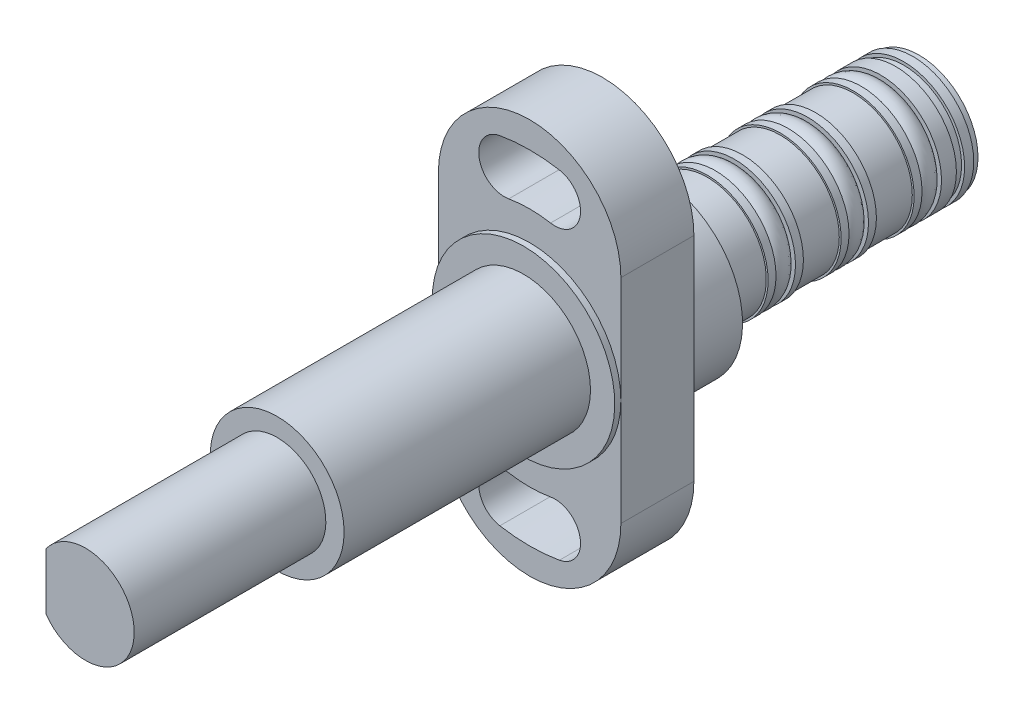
ISO-10303-21;
HEADER;
FILE_DESCRIPTION(('STEP AP214'),'2;1');
FILE_NAME('part.step','',(''),(''),'','','');
FILE_SCHEMA(('AUTOMOTIVE_DESIGN { 1 0 10303 214 1 1 1 1 }'));
ENDSEC;
DATA;
#1=APPLICATION_CONTEXT('core data for automotive mechanical design processes');
#2=APPLICATION_PROTOCOL_DEFINITION('international standard','automotive_design',2000,#1);
#3=PRODUCT_CONTEXT('',#1,'mechanical');
#4=PRODUCT('Part','Part','',(#3));
#5=PRODUCT_RELATED_PRODUCT_CATEGORY('part','',(#4));
#6=PRODUCT_DEFINITION_FORMATION('','',#4);
#7=PRODUCT_DEFINITION_CONTEXT('part definition',#1,'design');
#8=PRODUCT_DEFINITION('design','',#6,#7);
#9=PRODUCT_DEFINITION_SHAPE('','',#8);
#10=(LENGTH_UNIT() NAMED_UNIT(*) SI_UNIT(.MILLI.,.METRE.));
#11=(NAMED_UNIT(*) PLANE_ANGLE_UNIT() SI_UNIT($,.RADIAN.));
#12=(NAMED_UNIT(*) SI_UNIT($,.STERADIAN.) SOLID_ANGLE_UNIT());
#13=UNCERTAINTY_MEASURE_WITH_UNIT(LENGTH_MEASURE(1.E-05),#10,'distance_accuracy_value','');
#14=(GEOMETRIC_REPRESENTATION_CONTEXT(3) GLOBAL_UNCERTAINTY_ASSIGNED_CONTEXT((#13)) GLOBAL_UNIT_ASSIGNED_CONTEXT((#10,
#11,#12)) REPRESENTATION_CONTEXT('',''));
#15=CARTESIAN_POINT('',(0.,0.,0.));
#16=DIRECTION('',(0.,0.,1.));
#17=DIRECTION('',(1.,0.,0.));
#18=AXIS2_PLACEMENT_3D('',#15,#16,#17);
#19=CARTESIAN_POINT('',(-10.,0.,-42.5));
#20=DIRECTION('',(0.,0.,-1.));
#21=DIRECTION('',(-1.,0.,0.));
#22=AXIS2_PLACEMENT_3D('',#19,#20,#21);
#23=PLANE('',#22);
#24=CARTESIAN_POINT('',(0.,0.,-42.5));
#25=DIRECTION('',(0.,0.,1.));
#26=DIRECTION('',(1.,0.,0.));
#27=AXIS2_PLACEMENT_3D('',#24,#25,#26);
#28=CIRCLE('',#27,10.);
#29=CARTESIAN_POINT('',(10.,0.,-42.5));
#30=VERTEX_POINT('',#29);
#31=EDGE_CURVE('E902',#30,#30,#28,.T.);
#32=ORIENTED_EDGE('',*,*,#31,.F.);
#33=EDGE_LOOP('',(#32));
#34=FACE_BOUND('',#33,.T.);
#35=CARTESIAN_POINT('',(3.75897878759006E-13,0.,-42.5000000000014));
#36=DIRECTION('',(0.,0.,-1.));
#37=DIRECTION('',(0.,-1.,0.));
#38=AXIS2_PLACEMENT_3D('',#35,#36,#37);
#39=CIRCLE('',#38,8.99999999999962);
#40=CARTESIAN_POINT('',(3.75897878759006E-13,-8.99999999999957,-42.5000000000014));
#41=VERTEX_POINT('',#40);
#42=EDGE_CURVE('E9',#41,#41,#39,.F.);
#43=ORIENTED_EDGE('',*,*,#42,.T.);
#44=EDGE_LOOP('',(#43));
#45=FACE_BOUND('',#44,.T.);
#46=ADVANCED_FACE('F14',(#34,#45),#23,.T.);
#47=CARTESIAN_POINT('',(-10.,0.,-39.));
#48=DIRECTION('',(-1.,0.,0.));
#49=DIRECTION('',(0.,0.,1.));
#50=AXIS2_PLACEMENT_3D('',#47,#48,#49);
#51=CYLINDRICAL_SURFACE('',#50,0.749999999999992);
#52=CARTESIAN_POINT('',(-6.54935453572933,0.,-39.));
#53=DIRECTION('',(-1.,0.,0.));
#54=DIRECTION('',(0.,0.,1.));
#55=AXIS2_PLACEMENT_3D('',#52,#53,#54);
#56=CIRCLE('',#55,0.749999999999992);
#57=CARTESIAN_POINT('',(-6.54935453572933,0.,-38.25));
#58=VERTEX_POINT('',#57);
#59=EDGE_CURVE('E1024',#58,#58,#56,.T.);
#60=ORIENTED_EDGE('',*,*,#59,.T.);
#61=EDGE_LOOP('',(#60));
#62=FACE_BOUND('',#61,.T.);
#63=CARTESIAN_POINT('',(-6.5,0.,-38.25));
#64=CARTESIAN_POINT('',(-6.49999945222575,0.0419781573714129,-38.2500017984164));
#65=CARTESIAN_POINT('',(-6.49958904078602,0.0839831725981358,-38.2535362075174));
#66=CARTESIAN_POINT('',(-6.497991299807,0.166826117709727,-38.2675808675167));
#67=CARTESIAN_POINT('',(-6.49680314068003,0.207662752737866,-38.2780985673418));
#68=CARTESIAN_POINT('',(-6.49378386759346,0.286957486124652,-38.3057973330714));
#69=CARTESIAN_POINT('',(-6.49195316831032,0.325417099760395,-38.3229741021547));
#70=CARTESIAN_POINT('',(-6.48785287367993,0.398899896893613,-38.3634944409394));
#71=CARTESIAN_POINT('',(-6.48558335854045,0.433923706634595,-38.3868368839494));
#72=CARTESIAN_POINT('',(-6.48084717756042,0.499713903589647,-38.4391440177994));
#73=CARTESIAN_POINT('',(-6.47837972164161,0.530461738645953,-38.4681319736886));
#74=CARTESIAN_POINT('',(-6.47353219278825,0.586667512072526,-38.5308574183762));
#75=CARTESIAN_POINT('',(-6.47115212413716,0.61212519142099,-38.5645951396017));
#76=CARTESIAN_POINT('',(-6.46674098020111,0.657095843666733,-38.6359813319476));
#77=CARTESIAN_POINT('',(-6.4647109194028,0.676591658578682,-38.6736406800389));
#78=CARTESIAN_POINT('',(-6.46123985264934,0.708975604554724,-38.7517260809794));
#79=CARTESIAN_POINT('',(-6.4597988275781,0.721863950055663,-38.7921520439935));
#80=CARTESIAN_POINT('',(-6.4576764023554,0.740611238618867,-38.8744317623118));
#81=CARTESIAN_POINT('',(-6.45699163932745,0.746501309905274,-38.9162783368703));
#82=CARTESIAN_POINT('',(-6.45644892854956,0.751181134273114,-39.0003712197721));
#83=CARTESIAN_POINT('',(-6.45659095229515,0.749971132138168,-39.0426175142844));
#84=CARTESIAN_POINT('',(-6.45768269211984,0.740510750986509,-39.1260946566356));
#85=CARTESIAN_POINT('',(-6.45862848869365,0.7322945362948,-39.1673294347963));
#86=CARTESIAN_POINT('',(-6.46121509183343,0.709108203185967,-39.2478309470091));
#87=CARTESIAN_POINT('',(-6.46285591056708,0.694137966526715,-39.2870976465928));
#88=CARTESIAN_POINT('',(-6.46665215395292,0.657831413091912,-39.3626552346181));
#89=CARTESIAN_POINT('',(-6.46880878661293,0.636480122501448,-39.3989388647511));
#90=CARTESIAN_POINT('',(-6.47339269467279,0.588028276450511,-39.4674208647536));
#91=CARTESIAN_POINT('',(-6.47581998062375,0.560927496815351,-39.4996190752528));
#92=CARTESIAN_POINT('',(-6.48068914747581,0.501556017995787,-39.5592146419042));
#93=CARTESIAN_POINT('',(-6.48313103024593,0.4692558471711,-39.586582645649));
#94=CARTESIAN_POINT('',(-6.48774084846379,0.400504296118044,-39.6355128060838));
#95=CARTESIAN_POINT('',(-6.48990878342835,0.364052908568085,-39.6570749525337));
#96=CARTESIAN_POINT('',(-6.49372751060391,0.288011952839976,-39.6937808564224));
#97=CARTESIAN_POINT('',(-6.49537816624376,0.248421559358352,-39.7089229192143));
#98=CARTESIAN_POINT('',(-6.49797505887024,0.167236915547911,-39.7323362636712));
#99=CARTESIAN_POINT('',(-6.49892132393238,0.125642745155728,-39.7406078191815));
#100=CARTESIAN_POINT('',(-6.4999991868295,0.0418852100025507,-39.7500076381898));
#101=CARTESIAN_POINT('',(-6.50013539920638,-0.000273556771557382,-39.7511763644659));
#102=CARTESIAN_POINT('',(-6.4995902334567,-0.0841863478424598,-39.7464439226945));
#103=CARTESIAN_POINT('',(-6.49890887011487,-0.125940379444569,-39.7405428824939));
#104=CARTESIAN_POINT('',(-6.49680801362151,-0.207740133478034,-39.721872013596));
#105=CARTESIAN_POINT('',(-6.49539057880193,-0.247790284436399,-39.7091213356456));
#106=CARTESIAN_POINT('',(-6.49197639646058,-0.32518358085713,-39.6771329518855));
#107=CARTESIAN_POINT('',(-6.48997963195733,-0.362526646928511,-39.6578950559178));
#108=CARTESIAN_POINT('',(-6.48561818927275,-0.433627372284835,-39.6133794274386));
#109=CARTESIAN_POINT('',(-6.48325192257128,-0.467368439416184,-39.5880753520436));
#110=CARTESIAN_POINT('',(-6.4784215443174,-0.530138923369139,-39.5321831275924));
#111=CARTESIAN_POINT('',(-6.47595742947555,-0.559168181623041,-39.5015948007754));
#112=CARTESIAN_POINT('',(-6.4711949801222,-0.611833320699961,-39.435824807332));
#113=CARTESIAN_POINT('',(-6.46889750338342,-0.635442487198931,-39.4006216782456));
#114=CARTESIAN_POINT('',(-6.46474216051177,-0.676413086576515,-39.3267262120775));
#115=CARTESIAN_POINT('',(-6.46288428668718,-0.693774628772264,-39.2880339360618));
#116=CARTESIAN_POINT('',(-6.45982417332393,-0.721713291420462,-39.2083469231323));
#117=CARTESIAN_POINT('',(-6.45862044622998,-0.73230581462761,-39.1673576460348));
#118=CARTESIAN_POINT('',(-6.45700051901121,-0.746455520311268,-39.0841675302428));
#119=CARTESIAN_POINT('',(-6.45658428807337,-0.750012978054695,-39.0419667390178));
#120=CARTESIAN_POINT('',(-6.45658728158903,-0.749987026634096,-38.9578171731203));
#121=CARTESIAN_POINT('',(-6.45700159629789,-0.746445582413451,-38.9158683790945));
#122=CARTESIAN_POINT('',(-6.45860847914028,-0.732410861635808,-38.8331662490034));
#123=CARTESIAN_POINT('',(-6.45980104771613,-0.721917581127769,-38.7924129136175));
#124=CARTESIAN_POINT('',(-6.46282861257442,-0.694289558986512,-38.7132619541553));
#125=CARTESIAN_POINT('',(-6.46466344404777,-0.677156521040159,-38.6748637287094));
#126=CARTESIAN_POINT('',(-6.46876909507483,-0.636739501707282,-38.6014807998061));
#127=CARTESIAN_POINT('',(-6.47103991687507,-0.613455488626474,-38.5664961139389));
#128=CARTESIAN_POINT('',(-6.47577778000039,-0.561240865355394,-38.5007185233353));
#129=CARTESIAN_POINT('',(-6.47824586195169,-0.532278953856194,-38.4699505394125));
#130=CARTESIAN_POINT('',(-6.48309081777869,-0.469595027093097,-38.4136944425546));
#131=CARTESIAN_POINT('',(-6.48546766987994,-0.435871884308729,-38.3882075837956));
#132=CARTESIAN_POINT('',(-6.48987075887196,-0.3644984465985,-38.3431682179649));
#133=CARTESIAN_POINT('',(-6.49189582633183,-0.326835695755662,-38.3236353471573));
#134=CARTESIAN_POINT('',(-6.49535505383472,-0.248763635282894,-38.2911984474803));
#135=CARTESIAN_POINT('',(-6.49678986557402,-0.208357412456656,-38.2782871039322));
#136=CARTESIAN_POINT('',(-6.49855499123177,-0.139778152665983,-38.2626035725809));
#137=CARTESIAN_POINT('',(-6.4990942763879,-0.112040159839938,-38.2578838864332));
#138=CARTESIAN_POINT('',(-6.49981696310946,-0.0562054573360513,-38.2515815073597));
#139=CARTESIAN_POINT('',(-6.50000036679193,-0.0281087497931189,-38.2499987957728));
#140=CARTESIAN_POINT('',(-6.5,0.,-38.25));
#141=B_SPLINE_CURVE_WITH_KNOTS('',3,(#63,#64,#65,#66,#67,#68,#69,#70,#71,#72,#73,#74,#75,#76,
#77,#78,#79,#80,#81,#82,#83,#84,#85,#86,#87,#88,#89,#90,#91,#92,#93,#94,#95,#96,#97,#98,#99,
#100,#101,#102,#103,#104,#105,#106,#107,#108,#109,#110,#111,#112,#113,#114,#115,#116,#117,#118,
#119,#120,#121,#122,#123,#124,#125,#126,#127,#128,#129,#130,#131,#132,#133,#134,#135,#136,#137,
#138,#139,#140),.UNSPECIFIED.,.T.,.F.,(4,2,2,2,2,2,2,2,2,2,2,2,2,2,2,2,2,2,2,2,2,2,2,2,2,2,2,2,
2,2,2,2,2,2,2,2,2,2,4),(0.,0.12583181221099,0.251798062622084,0.377683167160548,
0.503545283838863,0.629937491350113,0.756335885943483,0.883094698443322,1.00984939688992,
1.13603815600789,1.26222256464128,1.38779515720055,1.51336994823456,1.63924175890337,
1.76511847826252,1.89173559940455,2.01835294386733,2.1450036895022,2.27164938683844,
2.39757293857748,2.52349421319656,2.64906524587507,2.77463995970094,2.90077019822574,
3.02690468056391,3.15364810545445,3.28038931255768,3.40684108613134,3.53328791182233,
3.65898945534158,3.78469107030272,3.91036045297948,4.03603048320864,4.16241384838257,
4.28882719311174,4.4156530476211,4.54233849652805,4.62659650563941,4.71085401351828),.UNSPECIFIED.);
#142=CARTESIAN_POINT('',(-6.5,0.,-38.25));
#143=VERTEX_POINT('',#142);
#144=EDGE_CURVE('E272',#143,#143,#141,.T.);
#145=ORIENTED_EDGE('',*,*,#144,.F.);
#146=EDGE_LOOP('',(#145));
#147=FACE_BOUND('',#146,.T.);
#148=ADVANCED_FACE('F284',(#62,#147),#51,.F.);
#149=CARTESIAN_POINT('',(0.,0.,-1.));
#150=DIRECTION('',(0.,0.,1.));
#151=DIRECTION('',(1.,0.,0.));
#152=AXIS2_PLACEMENT_3D('',#149,#150,#151);
#153=CYLINDRICAL_SURFACE('',#152,10.);
#154=ORIENTED_EDGE('',*,*,#31,.T.);
#155=EDGE_LOOP('',(#154));
#156=FACE_BOUND('',#155,.T.);
#157=CARTESIAN_POINT('',(0.,0.,-41.2));
#158=DIRECTION('',(0.,0.,-1.));
#159=DIRECTION('',(-1.,0.,0.));
#160=AXIS2_PLACEMENT_3D('',#157,#158,#159);
#161=CIRCLE('',#160,10.);
#162=CARTESIAN_POINT('',(-10.,0.,-41.2));
#163=VERTEX_POINT('',#162);
#164=EDGE_CURVE('E942',#163,#163,#161,.T.);
#165=ORIENTED_EDGE('',*,*,#164,.T.);
#166=EDGE_LOOP('',(#165));
#167=FACE_BOUND('',#166,.T.);
#168=ADVANCED_FACE('F667',(#156,#167),#153,.T.);
#169=CARTESIAN_POINT('',(0.,0.,-33.7));
#170=DIRECTION('',(0.,0.,1.));
#171=DIRECTION('',(1.,0.,0.));
#172=AXIS2_PLACEMENT_3D('',#169,#170,#171);
#173=CIRCLE('',#172,10.);
#174=CARTESIAN_POINT('',(10.,0.,-33.7));
#175=VERTEX_POINT('',#174);
#176=EDGE_CURVE('E1009',#175,#175,#173,.T.);
#177=ORIENTED_EDGE('',*,*,#176,.F.);
#178=EDGE_LOOP('',(#177));
#179=FACE_BOUND('',#178,.T.);
#180=CARTESIAN_POINT('',(0.,0.,-35.));
#181=DIRECTION('',(0.,0.,-1.));
#182=DIRECTION('',(-1.,0.,0.));
#183=AXIS2_PLACEMENT_3D('',#180,#181,#182);
#184=CIRCLE('',#183,10.);
#185=CARTESIAN_POINT('',(-10.,0.,-35.));
#186=VERTEX_POINT('',#185);
#187=EDGE_CURVE('E948',#186,#186,#184,.T.);
#188=ORIENTED_EDGE('',*,*,#187,.F.);
#189=EDGE_LOOP('',(#188));
#190=FACE_BOUND('',#189,.T.);
#191=ADVANCED_FACE('F328',(#179,#190),#153,.T.);
#192=CARTESIAN_POINT('',(-10.,0.,-39.));
#193=DIRECTION('',(-1.,0.,0.));
#194=DIRECTION('',(0.,0.,1.));
#195=AXIS2_PLACEMENT_3D('',#192,#193,#194);
#196=CYLINDRICAL_SURFACE('',#195,1.5);
#197=CARTESIAN_POINT('',(-7.,0.,-39.));
#198=DIRECTION('',(-1.,0.,0.));
#199=DIRECTION('',(0.,0.,1.));
#200=AXIS2_PLACEMENT_3D('',#197,#198,#199);
#201=CIRCLE('',#200,1.5);
#202=CARTESIAN_POINT('',(-7.,0.,-37.5));
#203=VERTEX_POINT('',#202);
#204=EDGE_CURVE('E1018',#203,#203,#201,.T.);
#205=ORIENTED_EDGE('',*,*,#204,.F.);
#206=EDGE_LOOP('',(#205));
#207=FACE_BOUND('',#206,.T.);
#208=CARTESIAN_POINT('',(-9.7,0.,-37.5));
#209=CARTESIAN_POINT('',(-9.69999863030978,-0.083720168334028,-37.5000034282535));
#210=CARTESIAN_POINT('',(-9.69890478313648,-0.167488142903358,-37.5070327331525));
#211=CARTESIAN_POINT('',(-9.6946464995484,-0.332680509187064,-37.5349558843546));
#212=CARTESIAN_POINT('',(-9.69148007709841,-0.41410257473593,-37.555863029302));
#213=CARTESIAN_POINT('',(-9.68343229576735,-0.57218873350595,-37.6109004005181));
#214=CARTESIAN_POINT('',(-9.67855226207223,-0.648856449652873,-37.6450204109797));
#215=CARTESIAN_POINT('',(-9.6676157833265,-0.795367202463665,-37.7254895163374));
#216=CARTESIAN_POINT('',(-9.66155949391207,-0.865211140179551,-37.7718369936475));
#217=CARTESIAN_POINT('',(-9.6488873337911,-0.996681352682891,-37.8758541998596));
#218=CARTESIAN_POINT('',(-9.64226765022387,-1.05824292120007,-37.933605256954));
#219=CARTESIAN_POINT('',(-9.62924444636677,-1.17084243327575,-38.0586152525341));
#220=CARTESIAN_POINT('',(-9.62284093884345,-1.22187975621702,-38.1258747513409));
#221=CARTESIAN_POINT('',(-9.61093814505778,-1.31223592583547,-38.2684297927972));
#222=CARTESIAN_POINT('',(-9.60544378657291,-1.35149179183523,-38.3437657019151));
#223=CARTESIAN_POINT('',(-9.5960336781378,-1.41676816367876,-38.5000609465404));
#224=CARTESIAN_POINT('',(-9.59211783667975,-1.44278943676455,-38.5810199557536));
#225=CARTESIAN_POINT('',(-9.58634574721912,-1.48065622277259,-38.7455812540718));
#226=CARTESIAN_POINT('',(-9.58447337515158,-1.49261277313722,-38.8291574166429));
#227=CARTESIAN_POINT('',(-9.58295131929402,-1.50235477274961,-38.9971491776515));
#228=CARTESIAN_POINT('',(-9.58330149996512,-1.5001410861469,-39.0815647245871));
#229=CARTESIAN_POINT('',(-9.58617024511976,-1.48169611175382,-39.2480524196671));
#230=CARTESIAN_POINT('',(-9.58866963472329,-1.46558877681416,-39.3301386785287));
#231=CARTESIAN_POINT('',(-9.59552520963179,-1.42000790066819,-39.4904293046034));
#232=CARTESIAN_POINT('',(-9.59988145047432,-1.39053395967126,-39.5686335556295));
#233=CARTESIAN_POINT('',(-9.6099809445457,-1.31892848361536,-39.7193157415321));
#234=CARTESIAN_POINT('',(-9.61572990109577,-1.27674472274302,-39.7917684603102));
#235=CARTESIAN_POINT('',(-9.62796298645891,-1.18095421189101,-39.9286140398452));
#236=CARTESIAN_POINT('',(-9.63444716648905,-1.12734666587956,-39.9930063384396));
#237=CARTESIAN_POINT('',(-9.6475046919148,-1.00955126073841,-40.1126213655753));
#238=CARTESIAN_POINT('',(-9.65407825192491,-0.945256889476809,-40.1677392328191));
#239=CARTESIAN_POINT('',(-9.66650986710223,-0.808275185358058,-40.2664187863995));
#240=CARTESIAN_POINT('',(-9.67236791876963,-0.735587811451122,-40.3099804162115));
#241=CARTESIAN_POINT('',(-9.68271515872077,-0.583790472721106,-40.3843174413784));
#242=CARTESIAN_POINT('',(-9.68720344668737,-0.504676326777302,-40.4150844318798));
#243=CARTESIAN_POINT('',(-9.69429801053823,-0.342319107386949,-40.4628660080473));
#244=CARTESIAN_POINT('',(-9.69690442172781,-0.259076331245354,-40.4798815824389));
#245=CARTESIAN_POINT('',(-9.69992356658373,-0.0917295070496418,-40.4995371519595));
#246=CARTESIAN_POINT('',(-9.70035828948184,-0.00764276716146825,-40.5023212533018));
#247=CARTESIAN_POINT('',(-9.69904503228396,0.159796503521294,-40.4938178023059));
#248=CARTESIAN_POINT('',(-9.69729712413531,0.243149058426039,-40.4825307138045));
#249=CARTESIAN_POINT('',(-9.69182860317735,0.406315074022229,-40.4463251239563));
#250=CARTESIAN_POINT('',(-9.68811819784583,0.486144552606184,-40.4214771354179));
#251=CARTESIAN_POINT('',(-9.67913927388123,0.640504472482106,-40.3589296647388));
#252=CARTESIAN_POINT('',(-9.67387067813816,0.715034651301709,-40.3212295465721));
#253=CARTESIAN_POINT('',(-9.66230595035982,0.857311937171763,-40.2337120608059));
#254=CARTESIAN_POINT('',(-9.65600222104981,0.925002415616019,-40.1838036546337));
#255=CARTESIAN_POINT('',(-9.64309168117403,1.05109843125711,-40.0734126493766));
#256=CARTESIAN_POINT('',(-9.63648485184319,1.10950339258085,-40.0129293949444));
#257=CARTESIAN_POINT('',(-9.62364264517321,1.21589746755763,-39.8824627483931));
#258=CARTESIAN_POINT('',(-9.61741107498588,1.26378977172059,-39.8123999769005));
#259=CARTESIAN_POINT('',(-9.60609335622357,1.34712527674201,-39.6651393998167));
#260=CARTESIAN_POINT('',(-9.60100717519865,1.38256883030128,-39.5879417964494));
#261=CARTESIAN_POINT('',(-9.59258394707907,1.43985208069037,-39.4288867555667));
#262=CARTESIAN_POINT('',(-9.58924045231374,1.4617419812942,-39.3470477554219));
#263=CARTESIAN_POINT('',(-9.58466427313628,1.49145587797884,-39.1807991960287));
#264=CARTESIAN_POINT('',(-9.58343143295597,1.49928091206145,-39.096389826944));
#265=CARTESIAN_POINT('',(-9.58322220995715,1.50061711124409,-38.928361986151));
#266=CARTESIAN_POINT('',(-9.58422182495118,1.49428053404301,-38.8447447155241));
#267=CARTESIAN_POINT('',(-9.58831259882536,1.46780045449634,-38.6797805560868));
#268=CARTESIAN_POINT('',(-9.59140375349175,1.44765697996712,-38.5984336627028));
#269=CARTESIAN_POINT('',(-9.59932072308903,1.39418996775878,-38.4403660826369));
#270=CARTESIAN_POINT('',(-9.60414504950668,1.36087773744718,-38.3636414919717));
#271=CARTESIAN_POINT('',(-9.61498648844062,1.28203409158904,-38.2168455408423));
#272=CARTESIAN_POINT('',(-9.6210036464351,1.23650221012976,-38.146774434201));
#273=CARTESIAN_POINT('',(-9.63362965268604,1.13396117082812,-38.0145020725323));
#274=CARTESIAN_POINT('',(-9.64024392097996,1.07683943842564,-37.9523885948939));
#275=CARTESIAN_POINT('',(-9.65327418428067,0.952978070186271,-37.8385752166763));
#276=CARTESIAN_POINT('',(-9.65969013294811,0.886236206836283,-37.7868777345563));
#277=CARTESIAN_POINT('',(-9.67164407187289,0.744566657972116,-37.6950908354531));
#278=CARTESIAN_POINT('',(-9.67717668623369,0.669593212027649,-37.6550713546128));
#279=CARTESIAN_POINT('',(-9.68668801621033,0.513937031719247,-37.5882538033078));
#280=CARTESIAN_POINT('',(-9.69066832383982,0.433260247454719,-37.5614421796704));
#281=CARTESIAN_POINT('',(-9.69572866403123,0.29352848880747,-37.52781378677));
#282=CARTESIAN_POINT('',(-9.69732209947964,0.235331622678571,-37.5173997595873));
#283=CARTESIAN_POINT('',(-9.69945824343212,0.118097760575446,-37.5034917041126));
#284=CARTESIAN_POINT('',(-9.70000096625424,0.0590607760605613,-37.4999975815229));
#285=CARTESIAN_POINT('',(-9.7,0.,-37.5));
#286=B_SPLINE_CURVE_WITH_KNOTS('',3,(#208,#209,#210,#211,#212,#213,#214,#215,#216,#217,#218,
#219,#220,#221,#222,#223,#224,#225,#226,#227,#228,#229,#230,#231,#232,#233,#234,#235,#236,#237,
#238,#239,#240,#241,#242,#243,#244,#245,#246,#247,#248,#249,#250,#251,#252,#253,#254,#255,#256,
#257,#258,#259,#260,#261,#262,#263,#264,#265,#266,#267,#268,#269,#270,#271,#272,#273,#274,#275,
#276,#277,#278,#279,#280,#281,#282,#283,#284,#285),.UNSPECIFIED.,.T.,.F.,(4,2,2,2,2,2,2,2,2,2,2,
2,2,2,2,2,2,2,2,2,2,2,2,2,2,2,2,2,2,2,2,2,2,2,2,2,2,2,4),(0.,0.250944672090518,
0.502130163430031,0.753121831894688,1.00408031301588,1.25689781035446,1.50973021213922,
1.76389105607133,2.01803716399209,2.27016309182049,2.52227364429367,2.77215797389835,
3.02204977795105,3.27298274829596,3.52393320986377,3.77755395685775,4.03117594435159,
4.28496427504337,4.53873435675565,4.78992962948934,5.0411166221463,5.29100978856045,
5.54091532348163,5.79274450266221,6.04458929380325,6.29866411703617,6.55273174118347,
6.8058525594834,7.05895469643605,7.30934872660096,7.55974225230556,7.80992124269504,
8.06010977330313,8.31285600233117,8.56566084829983,8.81994997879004,9.07397762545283,
9.25101010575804,9.42804017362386),.UNSPECIFIED.);
#287=CARTESIAN_POINT('',(-9.7,0.,-37.5));
#288=VERTEX_POINT('',#287);
#289=EDGE_CURVE('E333',#288,#288,#286,.T.);
#290=ORIENTED_EDGE('',*,*,#289,.F.);
#291=EDGE_LOOP('',(#290));
#292=FACE_BOUND('',#291,.T.);
#293=ADVANCED_FACE('F323',(#207,#292),#196,.F.);
#294=CARTESIAN_POINT('',(-7.,0.,-39.));
#295=DIRECTION('',(-1.,0.,0.));
#296=DIRECTION('',(0.,0.,1.));
#297=AXIS2_PLACEMENT_3D('',#294,#295,#296);
#298=CONICAL_SURFACE('',#297,1.5,1.02974425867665);
#299=ORIENTED_EDGE('',*,*,#204,.T.);
#300=EDGE_LOOP('',(#299));
#301=FACE_BOUND('',#300,.T.);
#302=ORIENTED_EDGE('',*,*,#59,.F.);
#303=EDGE_LOOP('',(#302));
#304=FACE_BOUND('',#303,.T.);
#305=ADVANCED_FACE('F319',(#301,#304),#298,.F.);
#306=CARTESIAN_POINT('',(-10.,0.,-33.7));
#307=DIRECTION('',(0.,0.,1.));
#308=DIRECTION('',(1.,0.,0.));
#309=AXIS2_PLACEMENT_3D('',#306,#307,#308);
#310=PLANE('',#309);
#311=CARTESIAN_POINT('',(3.7590512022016E-13,0.,-33.7000000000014));
#312=DIRECTION('',(0.,0.,-1.));
#313=DIRECTION('',(0.,-1.,0.));
#314=AXIS2_PLACEMENT_3D('',#311,#312,#313);
#315=CIRCLE('',#314,9.);
#316=CARTESIAN_POINT('',(3.7590512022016E-13,-8.99999999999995,-33.7000000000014));
#317=VERTEX_POINT('',#316);
#318=EDGE_CURVE('E392',#317,#317,#315,.T.);
#319=ORIENTED_EDGE('',*,*,#318,.T.);
#320=EDGE_LOOP('',(#319));
#321=FACE_BOUND('',#320,.T.);
#322=ORIENTED_EDGE('',*,*,#176,.T.);
#323=EDGE_LOOP('',(#322));
#324=FACE_BOUND('',#323,.T.);
#325=ADVANCED_FACE('F322',(#321,#324),#310,.T.);
#326=CARTESIAN_POINT('',(0.,0.,-1.));
#327=DIRECTION('',(0.,0.,1.));
#328=DIRECTION('',(1.,0.,0.));
#329=AXIS2_PLACEMENT_3D('',#326,#327,#328);
#330=CYLINDRICAL_SURFACE('',#329,9.7);
#331=CARTESIAN_POINT('',(0.,0.,-35.));
#332=DIRECTION('',(0.,0.,1.));
#333=DIRECTION('',(1.,0.,0.));
#334=AXIS2_PLACEMENT_3D('',#331,#332,#333);
#335=CIRCLE('',#334,9.7);
#336=CARTESIAN_POINT('',(9.7,0.,-35.));
#337=VERTEX_POINT('',#336);
#338=EDGE_CURVE('E341',#337,#337,#335,.T.);
#339=ORIENTED_EDGE('',*,*,#338,.F.);
#340=EDGE_LOOP('',(#339));
#341=FACE_BOUND('',#340,.T.);
#342=CARTESIAN_POINT('',(0.,0.,-41.2));
#343=DIRECTION('',(0.,0.,-1.));
#344=DIRECTION('',(-1.,0.,0.));
#345=AXIS2_PLACEMENT_3D('',#342,#343,#344);
#346=CIRCLE('',#345,9.7);
#347=CARTESIAN_POINT('',(-9.7,0.,-41.2));
#348=VERTEX_POINT('',#347);
#349=EDGE_CURVE('E940',#348,#348,#346,.T.);
#350=ORIENTED_EDGE('',*,*,#349,.F.);
#351=EDGE_LOOP('',(#350));
#352=FACE_BOUND('',#351,.T.);
#353=ORIENTED_EDGE('',*,*,#289,.T.);
#354=EDGE_LOOP('',(#353));
#355=FACE_BOUND('',#354,.T.);
#356=ADVANCED_FACE('F351',(#341,#352,#355),#330,.T.);
#357=CARTESIAN_POINT('',(0.,9.7,-35.));
#358=DIRECTION('',(0.,0.,1.));
#359=DIRECTION('',(1.,0.,0.));
#360=AXIS2_PLACEMENT_3D('',#357,#358,#359);
#361=PLANE('',#360);
#362=ORIENTED_EDGE('',*,*,#338,.T.);
#363=EDGE_LOOP('',(#362));
#364=FACE_BOUND('',#363,.T.);
#365=ORIENTED_EDGE('',*,*,#187,.T.);
#366=EDGE_LOOP('',(#365));
#367=FACE_BOUND('',#366,.T.);
#368=ADVANCED_FACE('F355',(#364,#367),#361,.F.);
#369=CARTESIAN_POINT('',(0.,10.,-41.2));
#370=DIRECTION('',(0.,0.,-1.));
#371=DIRECTION('',(-1.,0.,0.));
#372=AXIS2_PLACEMENT_3D('',#369,#370,#371);
#373=PLANE('',#372);
#374=ORIENTED_EDGE('',*,*,#164,.F.);
#375=EDGE_LOOP('',(#374));
#376=FACE_BOUND('',#375,.T.);
#377=ORIENTED_EDGE('',*,*,#349,.T.);
#378=EDGE_LOOP('',(#377));
#379=FACE_BOUND('',#378,.T.);
#380=ADVANCED_FACE('F294',(#376,#379),#373,.F.);
#381=CARTESIAN_POINT('',(0.,0.,-1.));
#382=DIRECTION('',(0.,0.,-1.));
#383=DIRECTION('',(-1.,0.,0.));
#384=AXIS2_PLACEMENT_3D('',#381,#382,#383);
#385=CYLINDRICAL_SURFACE('',#384,6.5);
#386=ORIENTED_EDGE('',*,*,#144,.T.);
#387=EDGE_LOOP('',(#386));
#388=FACE_BOUND('',#387,.T.);
#389=ADVANCED_FACE('F288',(#388),#385,.T.);
#390=CARTESIAN_POINT('',(8.99989452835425,0.0435715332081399,-32.1000000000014));
#391=DIRECTION('',(-0.00484128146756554,0.999988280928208,0.));
#392=DIRECTION('',(0.,0.,1.));
#393=AXIS2_PLACEMENT_3D('',#390,#391,#392);
#394=ELLIPSE('',#393,1.6,1.);
#395=CARTESIAN_POINT('',(3.7590512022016E-13,0.,-33.7000000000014));
#396=DIRECTION('',(0.,0.,-1.));
#397=AXIS1_PLACEMENT('',#395,#396);
#398=SURFACE_OF_REVOLUTION('',#394,#397);
#399=CARTESIAN_POINT('',(3.75907017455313E-13,0.,-30.5000000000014));
#400=DIRECTION('',(0.,0.,-1.));
#401=DIRECTION('',(0.,-1.,0.));
#402=AXIS2_PLACEMENT_3D('',#399,#400,#401);
#403=CIRCLE('',#402,9.);
#404=CARTESIAN_POINT('',(3.75907017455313E-13,-8.99999999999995,-30.5000000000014));
#405=VERTEX_POINT('',#404);
#406=EDGE_CURVE('E390',#405,#405,#403,.T.);
#407=ORIENTED_EDGE('',*,*,#406,.T.);
#408=EDGE_LOOP('',(#407));
#409=FACE_BOUND('',#408,.T.);
#410=ORIENTED_EDGE('',*,*,#318,.F.);
#411=EDGE_LOOP('',(#410));
#412=FACE_BOUND('',#411,.T.);
#413=ADVANCED_FACE('F293',(#409,#412),#398,.T.);
#414=CARTESIAN_POINT('',(0.,0.,-1.));
#415=DIRECTION('',(0.,0.,1.));
#416=DIRECTION('',(1.,0.,0.));
#417=AXIS2_PLACEMENT_3D('',#414,#415,#416);
#418=CYLINDRICAL_SURFACE('',#417,9.7);
#419=CARTESIAN_POINT('',(0.,0.,-9.));
#420=DIRECTION('',(0.,0.,-1.));
#421=DIRECTION('',(-1.,0.,0.));
#422=AXIS2_PLACEMENT_3D('',#419,#420,#421);
#423=CIRCLE('',#422,9.7);
#424=CARTESIAN_POINT('',(-9.7,0.,-9.));
#425=VERTEX_POINT('',#424);
#426=EDGE_CURVE('E246',#425,#425,#423,.F.);
#427=ORIENTED_EDGE('',*,*,#426,.F.);
#428=EDGE_LOOP('',(#427));
#429=FACE_BOUND('',#428,.T.);
#430=CARTESIAN_POINT('',(0.,0.,-17.2));
#431=DIRECTION('',(0.,0.,-1.));
#432=DIRECTION('',(-1.,0.,0.));
#433=AXIS2_PLACEMENT_3D('',#430,#431,#432);
#434=CIRCLE('',#433,9.7);
#435=CARTESIAN_POINT('',(-9.7,0.,-17.2));
#436=VERTEX_POINT('',#435);
#437=EDGE_CURVE('E959',#436,#436,#434,.T.);
#438=ORIENTED_EDGE('',*,*,#437,.F.);
#439=EDGE_LOOP('',(#438));
#440=FACE_BOUND('',#439,.T.);
#441=ADVANCED_FACE('F813',(#429,#440),#418,.T.);
#442=CARTESIAN_POINT('',(0.,10.,-17.2));
#443=DIRECTION('',(0.,0.,-1.));
#444=DIRECTION('',(-1.,0.,0.));
#445=AXIS2_PLACEMENT_3D('',#442,#443,#444);
#446=PLANE('',#445);
#447=CARTESIAN_POINT('',(0.,0.,-17.2));
#448=DIRECTION('',(0.,0.,-1.));
#449=DIRECTION('',(-1.,0.,0.));
#450=AXIS2_PLACEMENT_3D('',#447,#448,#449);
#451=CIRCLE('',#450,10.);
#452=CARTESIAN_POINT('',(-10.,0.,-17.2));
#453=VERTEX_POINT('',#452);
#454=EDGE_CURVE('E343',#453,#453,#451,.T.);
#455=ORIENTED_EDGE('',*,*,#454,.F.);
#456=EDGE_LOOP('',(#455));
#457=FACE_BOUND('',#456,.T.);
#458=ORIENTED_EDGE('',*,*,#437,.T.);
#459=EDGE_LOOP('',(#458));
#460=FACE_BOUND('',#459,.T.);
#461=ADVANCED_FACE('F804',(#457,#460),#446,.F.);
#462=CARTESIAN_POINT('',(0.,0.,-18.5));
#463=DIRECTION('',(0.,0.,1.));
#464=DIRECTION('',(1.,0.,0.));
#465=AXIS2_PLACEMENT_3D('',#462,#463,#464);
#466=CIRCLE('',#465,10.);
#467=CARTESIAN_POINT('',(10.,0.,-18.5));
#468=VERTEX_POINT('',#467);
#469=EDGE_CURVE('E909',#468,#468,#466,.T.);
#470=ORIENTED_EDGE('',*,*,#469,.T.);
#471=EDGE_LOOP('',(#470));
#472=FACE_BOUND('',#471,.T.);
#473=ORIENTED_EDGE('',*,*,#454,.T.);
#474=EDGE_LOOP('',(#473));
#475=FACE_BOUND('',#474,.T.);
#476=ADVANCED_FACE('F657',(#472,#475),#153,.T.);
#477=CARTESIAN_POINT('',(-10.,0.,-18.5));
#478=DIRECTION('',(0.,0.,-1.));
#479=DIRECTION('',(-1.,0.,0.));
#480=AXIS2_PLACEMENT_3D('',#477,#478,#479);
#481=PLANE('',#480);
#482=ORIENTED_EDGE('',*,*,#469,.F.);
#483=EDGE_LOOP('',(#482));
#484=FACE_BOUND('',#483,.T.);
#485=CARTESIAN_POINT('',(3.75912752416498E-13,0.,-18.5000000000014));
#486=DIRECTION('',(0.,0.,-1.));
#487=DIRECTION('',(0.,-1.,0.));
#488=AXIS2_PLACEMENT_3D('',#485,#486,#487);
#489=CIRCLE('',#488,9.);
#490=CARTESIAN_POINT('',(3.75912752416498E-13,-8.99999999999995,-18.5000000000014));
#491=VERTEX_POINT('',#490);
#492=EDGE_CURVE('E280',#491,#491,#489,.T.);
#493=ORIENTED_EDGE('',*,*,#492,.F.);
#494=EDGE_LOOP('',(#493));
#495=FACE_BOUND('',#494,.T.);
#496=ADVANCED_FACE('F785',(#484,#495),#481,.T.);
#497=CARTESIAN_POINT('',(-6.5,0.,-24.25));
#498=CARTESIAN_POINT('',(-6.49999945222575,0.0419781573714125,-24.2500017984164));
#499=CARTESIAN_POINT('',(-6.49958904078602,0.0839831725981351,-24.2535362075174));
#500=CARTESIAN_POINT('',(-6.497991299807,0.166826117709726,-24.2675808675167));
#501=CARTESIAN_POINT('',(-6.49680314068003,0.207662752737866,-24.2780985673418));
#502=CARTESIAN_POINT('',(-6.49378386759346,0.286957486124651,-24.3057973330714));
#503=CARTESIAN_POINT('',(-6.49195316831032,0.325417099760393,-24.3229741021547));
#504=CARTESIAN_POINT('',(-6.48785287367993,0.398899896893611,-24.3634944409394));
#505=CARTESIAN_POINT('',(-6.48558335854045,0.433923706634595,-24.3868368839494));
#506=CARTESIAN_POINT('',(-6.48084717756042,0.499713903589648,-24.4391440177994));
#507=CARTESIAN_POINT('',(-6.47837972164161,0.530461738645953,-24.4681319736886));
#508=CARTESIAN_POINT('',(-6.47353219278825,0.586667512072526,-24.5308574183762));
#509=CARTESIAN_POINT('',(-6.47115212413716,0.61212519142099,-24.5645951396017));
#510=CARTESIAN_POINT('',(-6.46674098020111,0.657095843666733,-24.6359813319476));
#511=CARTESIAN_POINT('',(-6.4647109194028,0.676591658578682,-24.6736406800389));
#512=CARTESIAN_POINT('',(-6.46123985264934,0.708975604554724,-24.7517260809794));
#513=CARTESIAN_POINT('',(-6.4597988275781,0.721863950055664,-24.7921520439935));
#514=CARTESIAN_POINT('',(-6.4576764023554,0.740611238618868,-24.8744317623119));
#515=CARTESIAN_POINT('',(-6.45699163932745,0.746501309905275,-24.9162783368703));
#516=CARTESIAN_POINT('',(-6.45644892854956,0.751181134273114,-25.0003712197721));
#517=CARTESIAN_POINT('',(-6.45659095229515,0.749971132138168,-25.0426175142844));
#518=CARTESIAN_POINT('',(-6.45768269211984,0.740510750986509,-25.1260946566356));
#519=CARTESIAN_POINT('',(-6.45862848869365,0.732294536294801,-25.1673294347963));
#520=CARTESIAN_POINT('',(-6.46121509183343,0.709108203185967,-25.2478309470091));
#521=CARTESIAN_POINT('',(-6.46285591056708,0.694137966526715,-25.2870976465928));
#522=CARTESIAN_POINT('',(-6.46665215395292,0.657831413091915,-25.3626552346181));
#523=CARTESIAN_POINT('',(-6.46880878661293,0.636480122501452,-25.3989388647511));
#524=CARTESIAN_POINT('',(-6.47339269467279,0.588028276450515,-25.4674208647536));
#525=CARTESIAN_POINT('',(-6.47581998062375,0.560927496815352,-25.4996190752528));
#526=CARTESIAN_POINT('',(-6.48068914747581,0.501556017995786,-25.5592146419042));
#527=CARTESIAN_POINT('',(-6.48313103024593,0.4692558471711,-25.586582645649));
#528=CARTESIAN_POINT('',(-6.48774084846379,0.400504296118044,-25.6355128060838));
#529=CARTESIAN_POINT('',(-6.48990878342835,0.364052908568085,-25.6570749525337));
#530=CARTESIAN_POINT('',(-6.49372751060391,0.288011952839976,-25.6937808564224));
#531=CARTESIAN_POINT('',(-6.49537816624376,0.248421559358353,-25.7089229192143));
#532=CARTESIAN_POINT('',(-6.49797505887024,0.167236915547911,-25.7323362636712));
#533=CARTESIAN_POINT('',(-6.49892132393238,0.125642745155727,-25.7406078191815));
#534=CARTESIAN_POINT('',(-6.4999991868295,0.0418852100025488,-25.7500076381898));
#535=CARTESIAN_POINT('',(-6.50013539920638,-0.000273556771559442,-25.7511763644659));
#536=CARTESIAN_POINT('',(-6.4995902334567,-0.0841863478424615,-25.7464439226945));
#537=CARTESIAN_POINT('',(-6.49890887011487,-0.12594037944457,-25.7405428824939));
#538=CARTESIAN_POINT('',(-6.49680801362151,-0.207740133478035,-25.721872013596));
#539=CARTESIAN_POINT('',(-6.49539057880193,-0.2477902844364,-25.7091213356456));
#540=CARTESIAN_POINT('',(-6.49197639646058,-0.325183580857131,-25.6771329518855));
#541=CARTESIAN_POINT('',(-6.48997963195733,-0.36252664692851,-25.6578950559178));
#542=CARTESIAN_POINT('',(-6.48561818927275,-0.433627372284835,-25.6133794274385));
#543=CARTESIAN_POINT('',(-6.48325192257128,-0.467368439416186,-25.5880753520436));
#544=CARTESIAN_POINT('',(-6.4784215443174,-0.530138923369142,-25.5321831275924));
#545=CARTESIAN_POINT('',(-6.47595742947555,-0.559168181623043,-25.5015948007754));
#546=CARTESIAN_POINT('',(-6.4711949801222,-0.611833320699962,-25.435824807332));
#547=CARTESIAN_POINT('',(-6.46889750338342,-0.635442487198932,-25.4006216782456));
#548=CARTESIAN_POINT('',(-6.46474216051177,-0.676413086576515,-25.3267262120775));
#549=CARTESIAN_POINT('',(-6.46288428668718,-0.693774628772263,-25.2880339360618));
#550=CARTESIAN_POINT('',(-6.45982417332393,-0.721713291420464,-25.2083469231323));
#551=CARTESIAN_POINT('',(-6.45862044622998,-0.732305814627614,-25.1673576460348));
#552=CARTESIAN_POINT('',(-6.4570005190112,-0.746455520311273,-25.0841675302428));
#553=CARTESIAN_POINT('',(-6.45658428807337,-0.750012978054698,-25.0419667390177));
#554=CARTESIAN_POINT('',(-6.45658728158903,-0.749987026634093,-24.9578171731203));
#555=CARTESIAN_POINT('',(-6.45700159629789,-0.746445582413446,-24.9158683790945));
#556=CARTESIAN_POINT('',(-6.45860847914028,-0.732410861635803,-24.8331662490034));
#557=CARTESIAN_POINT('',(-6.45980104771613,-0.721917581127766,-24.7924129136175));
#558=CARTESIAN_POINT('',(-6.46282861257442,-0.694289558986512,-24.7132619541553));
#559=CARTESIAN_POINT('',(-6.46466344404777,-0.677156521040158,-24.6748637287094));
#560=CARTESIAN_POINT('',(-6.46876909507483,-0.636739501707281,-24.6014807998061));
#561=CARTESIAN_POINT('',(-6.47103991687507,-0.613455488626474,-24.5664961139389));
#562=CARTESIAN_POINT('',(-6.47577778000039,-0.561240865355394,-24.5007185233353));
#563=CARTESIAN_POINT('',(-6.47824586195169,-0.532278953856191,-24.4699505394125));
#564=CARTESIAN_POINT('',(-6.48309081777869,-0.469595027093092,-24.4136944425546));
#565=CARTESIAN_POINT('',(-6.48546766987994,-0.435871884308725,-24.3882075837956));
#566=CARTESIAN_POINT('',(-6.48987075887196,-0.3644984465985,-24.3431682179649));
#567=CARTESIAN_POINT('',(-6.49189582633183,-0.326835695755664,-24.3236353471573));
#568=CARTESIAN_POINT('',(-6.49535505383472,-0.248763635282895,-24.2911984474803));
#569=CARTESIAN_POINT('',(-6.49678986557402,-0.208357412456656,-24.2782871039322));
#570=CARTESIAN_POINT('',(-6.49855499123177,-0.139778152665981,-24.2626035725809));
#571=CARTESIAN_POINT('',(-6.4990942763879,-0.112040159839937,-24.2578838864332));
#572=CARTESIAN_POINT('',(-6.49981696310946,-0.0562054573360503,-24.2515815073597));
#573=CARTESIAN_POINT('',(-6.50000036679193,-0.0281087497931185,-24.2499987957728));
#574=CARTESIAN_POINT('',(-6.5,0.,-24.25));
#575=B_SPLINE_CURVE_WITH_KNOTS('',3,(#497,#498,#499,#500,#501,#502,#503,#504,#505,#506,#507,
#508,#509,#510,#511,#512,#513,#514,#515,#516,#517,#518,#519,#520,#521,#522,#523,#524,#525,#526,
#527,#528,#529,#530,#531,#532,#533,#534,#535,#536,#537,#538,#539,#540,#541,#542,#543,#544,#545,
#546,#547,#548,#549,#550,#551,#552,#553,#554,#555,#556,#557,#558,#559,#560,#561,#562,#563,#564,
#565,#566,#567,#568,#569,#570,#571,#572,#573,#574),.UNSPECIFIED.,.T.,.F.,(4,2,2,2,2,2,2,2,2,2,2,
2,2,2,2,2,2,2,2,2,2,2,2,2,2,2,2,2,2,2,2,2,2,2,2,2,2,2,4),(0.,0.125831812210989,
0.251798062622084,0.377683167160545,0.503545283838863,0.629937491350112,0.756335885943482,
0.883094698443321,1.00984939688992,1.1360381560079,1.26222256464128,1.38779515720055,
1.51336994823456,1.63924175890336,1.76511847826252,1.89173559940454,2.01835294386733,
2.1450036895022,2.27164938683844,2.39757293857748,2.52349421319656,2.64906524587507,
2.77463995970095,2.90077019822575,3.02690468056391,3.15364810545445,3.28038931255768,
3.40684108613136,3.53328791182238,3.65898945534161,3.78469107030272,3.91036045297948,
4.03603048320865,4.16241384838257,4.28882719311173,4.41565304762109,4.54233849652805,
4.62659650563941,4.71085401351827),.UNSPECIFIED.);
#576=CARTESIAN_POINT('',(-6.5,0.,-24.25));
#577=VERTEX_POINT('',#576);
#578=EDGE_CURVE('E281',#577,#577,#575,.T.);
#579=ORIENTED_EDGE('',*,*,#578,.T.);
#580=EDGE_LOOP('',(#579));
#581=FACE_BOUND('',#580,.T.);
#582=ADVANCED_FACE('F296',(#581),#385,.T.);
#583=CARTESIAN_POINT('',(8.99989452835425,0.0435715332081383,-20.1000000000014));
#584=DIRECTION('',(-0.00484128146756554,0.999988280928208,0.));
#585=DIRECTION('',(0.,0.,1.));
#586=AXIS2_PLACEMENT_3D('',#583,#584,#585);
#587=ELLIPSE('',#586,1.6,1.);
#588=CARTESIAN_POINT('',(3.75910855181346E-13,0.,-21.7000000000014));
#589=DIRECTION('',(0.,0.,-1.));
#590=AXIS1_PLACEMENT('',#588,#589);
#591=SURFACE_OF_REVOLUTION('',#587,#590);
#592=ORIENTED_EDGE('',*,*,#492,.T.);
#593=EDGE_LOOP('',(#592));
#594=FACE_BOUND('',#593,.T.);
#595=CARTESIAN_POINT('',(3.75910855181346E-13,0.,-21.7000000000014));
#596=DIRECTION('',(0.,0.,-1.));
#597=DIRECTION('',(0.,-1.,0.));
#598=AXIS2_PLACEMENT_3D('',#595,#596,#597);
#599=CIRCLE('',#598,9.);
#600=CARTESIAN_POINT('',(3.75910855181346E-13,-8.99999999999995,-21.7000000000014));
#601=VERTEX_POINT('',#600);
#602=EDGE_CURVE('E387',#601,#601,#599,.T.);
#603=ORIENTED_EDGE('',*,*,#602,.F.);
#604=EDGE_LOOP('',(#603));
#605=FACE_BOUND('',#604,.T.);
#606=ADVANCED_FACE('F317',(#594,#605),#591,.T.);
#607=CARTESIAN_POINT('',(-10.,0.,-25.));
#608=DIRECTION('',(-1.,0.,0.));
#609=DIRECTION('',(0.,0.,1.));
#610=AXIS2_PLACEMENT_3D('',#607,#608,#609);
#611=CYLINDRICAL_SURFACE('',#610,0.749999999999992);
#612=CARTESIAN_POINT('',(-6.54935453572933,0.,-25.));
#613=DIRECTION('',(-1.,0.,0.));
#614=DIRECTION('',(0.,0.,1.));
#615=AXIS2_PLACEMENT_3D('',#612,#613,#614);
#616=CIRCLE('',#615,0.749999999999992);
#617=CARTESIAN_POINT('',(-6.54935453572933,0.,-24.25));
#618=VERTEX_POINT('',#617);
#619=EDGE_CURVE('E1029',#618,#618,#616,.T.);
#620=ORIENTED_EDGE('',*,*,#619,.T.);
#621=EDGE_LOOP('',(#620));
#622=FACE_BOUND('',#621,.T.);
#623=ORIENTED_EDGE('',*,*,#578,.F.);
#624=EDGE_LOOP('',(#623));
#625=FACE_BOUND('',#624,.T.);
#626=ADVANCED_FACE('F312',(#622,#625),#611,.F.);
#627=CARTESIAN_POINT('',(-10.,0.,-21.7));
#628=DIRECTION('',(0.,0.,1.));
#629=DIRECTION('',(1.,0.,0.));
#630=AXIS2_PLACEMENT_3D('',#627,#628,#629);
#631=PLANE('',#630);
#632=ORIENTED_EDGE('',*,*,#602,.T.);
#633=EDGE_LOOP('',(#632));
#634=FACE_BOUND('',#633,.T.);
#635=CARTESIAN_POINT('',(0.,0.,-21.7));
#636=DIRECTION('',(0.,0.,1.));
#637=DIRECTION('',(1.,0.,0.));
#638=AXIS2_PLACEMENT_3D('',#635,#636,#637);
#639=CIRCLE('',#638,10.);
#640=CARTESIAN_POINT('',(10.,0.,-21.7));
#641=VERTEX_POINT('',#640);
#642=EDGE_CURVE('E915',#641,#641,#639,.T.);
#643=ORIENTED_EDGE('',*,*,#642,.T.);
#644=EDGE_LOOP('',(#643));
#645=FACE_BOUND('',#644,.T.);
#646=ADVANCED_FACE('F316',(#634,#645),#631,.T.);
#647=CARTESIAN_POINT('',(-7.,0.,-25.));
#648=DIRECTION('',(-1.,0.,0.));
#649=DIRECTION('',(0.,0.,1.));
#650=AXIS2_PLACEMENT_3D('',#647,#648,#649);
#651=CONICAL_SURFACE('',#650,1.5,1.02974425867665);
#652=CARTESIAN_POINT('',(-7.,0.,-25.));
#653=DIRECTION('',(-1.,0.,0.));
#654=DIRECTION('',(0.,0.,1.));
#655=AXIS2_PLACEMENT_3D('',#652,#653,#654);
#656=CIRCLE('',#655,1.5);
#657=CARTESIAN_POINT('',(-7.,0.,-23.5));
#658=VERTEX_POINT('',#657);
#659=EDGE_CURVE('E1013',#658,#658,#656,.T.);
#660=ORIENTED_EDGE('',*,*,#659,.T.);
#661=EDGE_LOOP('',(#660));
#662=FACE_BOUND('',#661,.T.);
#663=ORIENTED_EDGE('',*,*,#619,.F.);
#664=EDGE_LOOP('',(#663));
#665=FACE_BOUND('',#664,.T.);
#666=ADVANCED_FACE('F330',(#662,#665),#651,.F.);
#667=ORIENTED_EDGE('',*,*,#642,.F.);
#668=EDGE_LOOP('',(#667));
#669=FACE_BOUND('',#668,.T.);
#670=CARTESIAN_POINT('',(0.,0.,-23.));
#671=DIRECTION('',(0.,0.,-1.));
#672=DIRECTION('',(-1.,0.,0.));
#673=AXIS2_PLACEMENT_3D('',#670,#671,#672);
#674=CIRCLE('',#673,10.);
#675=CARTESIAN_POINT('',(-10.,0.,-23.));
#676=VERTEX_POINT('',#675);
#677=EDGE_CURVE('E957',#676,#676,#674,.T.);
#678=ORIENTED_EDGE('',*,*,#677,.F.);
#679=EDGE_LOOP('',(#678));
#680=FACE_BOUND('',#679,.T.);
#681=ADVANCED_FACE('F715',(#669,#680),#153,.T.);
#682=CARTESIAN_POINT('',(-10.,0.,-25.));
#683=DIRECTION('',(-1.,0.,0.));
#684=DIRECTION('',(0.,0.,1.));
#685=AXIS2_PLACEMENT_3D('',#682,#683,#684);
#686=CYLINDRICAL_SURFACE('',#685,1.5);
#687=ORIENTED_EDGE('',*,*,#659,.F.);
#688=EDGE_LOOP('',(#687));
#689=FACE_BOUND('',#688,.T.);
#690=CARTESIAN_POINT('',(-9.7,0.,-23.5));
#691=CARTESIAN_POINT('',(-9.69999863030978,-0.0837201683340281,-23.5000034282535));
#692=CARTESIAN_POINT('',(-9.69890478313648,-0.167488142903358,-23.5070327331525));
#693=CARTESIAN_POINT('',(-9.6946464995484,-0.332680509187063,-23.5349558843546));
#694=CARTESIAN_POINT('',(-9.69148007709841,-0.414102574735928,-23.555863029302));
#695=CARTESIAN_POINT('',(-9.68343229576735,-0.572188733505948,-23.6109004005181));
#696=CARTESIAN_POINT('',(-9.67855226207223,-0.648856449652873,-23.6450204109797));
#697=CARTESIAN_POINT('',(-9.6676157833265,-0.795367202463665,-23.7254895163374));
#698=CARTESIAN_POINT('',(-9.66155949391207,-0.86521114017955,-23.7718369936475));
#699=CARTESIAN_POINT('',(-9.6488873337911,-0.99668135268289,-23.8758541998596));
#700=CARTESIAN_POINT('',(-9.64226765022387,-1.05824292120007,-23.933605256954));
#701=CARTESIAN_POINT('',(-9.62924444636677,-1.17084243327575,-24.0586152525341));
#702=CARTESIAN_POINT('',(-9.62284093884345,-1.22187975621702,-24.1258747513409));
#703=CARTESIAN_POINT('',(-9.61093814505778,-1.31223592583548,-24.2684297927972));
#704=CARTESIAN_POINT('',(-9.60544378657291,-1.35149179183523,-24.3437657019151));
#705=CARTESIAN_POINT('',(-9.5960336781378,-1.41676816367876,-24.5000609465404));
#706=CARTESIAN_POINT('',(-9.59211783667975,-1.44278943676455,-24.5810199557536));
#707=CARTESIAN_POINT('',(-9.58634574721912,-1.48065622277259,-24.7455812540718));
#708=CARTESIAN_POINT('',(-9.58447337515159,-1.49261277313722,-24.8291574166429));
#709=CARTESIAN_POINT('',(-9.58295131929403,-1.50235477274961,-24.9971491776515));
#710=CARTESIAN_POINT('',(-9.58330149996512,-1.5001410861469,-25.0815647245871));
#711=CARTESIAN_POINT('',(-9.58617024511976,-1.48169611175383,-25.2480524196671));
#712=CARTESIAN_POINT('',(-9.58866963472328,-1.46558877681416,-25.3301386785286));
#713=CARTESIAN_POINT('',(-9.59552520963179,-1.42000790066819,-25.4904293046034));
#714=CARTESIAN_POINT('',(-9.59988145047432,-1.39053395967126,-25.5686335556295));
#715=CARTESIAN_POINT('',(-9.6099809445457,-1.31892848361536,-25.7193157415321));
#716=CARTESIAN_POINT('',(-9.61572990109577,-1.27674472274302,-25.7917684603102));
#717=CARTESIAN_POINT('',(-9.62796298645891,-1.18095421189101,-25.9286140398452));
#718=CARTESIAN_POINT('',(-9.63444716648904,-1.12734666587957,-25.9930063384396));
#719=CARTESIAN_POINT('',(-9.64750469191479,-1.00955126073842,-26.1126213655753));
#720=CARTESIAN_POINT('',(-9.65407825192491,-0.945256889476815,-26.1677392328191));
#721=CARTESIAN_POINT('',(-9.66650986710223,-0.808275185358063,-26.2664187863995));
#722=CARTESIAN_POINT('',(-9.67236791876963,-0.735587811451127,-26.3099804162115));
#723=CARTESIAN_POINT('',(-9.68271515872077,-0.583790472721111,-26.3843174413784));
#724=CARTESIAN_POINT('',(-9.68720344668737,-0.504676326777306,-26.4150844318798));
#725=CARTESIAN_POINT('',(-9.69429801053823,-0.342319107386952,-26.4628660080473));
#726=CARTESIAN_POINT('',(-9.69690442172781,-0.259076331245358,-26.4798815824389));
#727=CARTESIAN_POINT('',(-9.69992356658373,-0.0917295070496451,-26.4995371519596));
#728=CARTESIAN_POINT('',(-9.70035828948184,-0.00764276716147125,-26.5023212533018));
#729=CARTESIAN_POINT('',(-9.69904503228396,0.159796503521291,-26.4938178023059));
#730=CARTESIAN_POINT('',(-9.69729712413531,0.243149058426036,-26.4825307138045));
#731=CARTESIAN_POINT('',(-9.69182860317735,0.406315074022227,-26.4463251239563));
#732=CARTESIAN_POINT('',(-9.68811819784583,0.486144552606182,-26.4214771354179));
#733=CARTESIAN_POINT('',(-9.67913927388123,0.640504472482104,-26.3589296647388));
#734=CARTESIAN_POINT('',(-9.67387067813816,0.715034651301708,-26.3212295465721));
#735=CARTESIAN_POINT('',(-9.66230595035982,0.857311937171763,-26.2337120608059));
#736=CARTESIAN_POINT('',(-9.65600222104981,0.925002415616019,-26.1838036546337));
#737=CARTESIAN_POINT('',(-9.64309168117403,1.05109843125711,-26.0734126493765));
#738=CARTESIAN_POINT('',(-9.63648485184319,1.10950339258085,-26.0129293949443));
#739=CARTESIAN_POINT('',(-9.62364264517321,1.21589746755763,-25.8824627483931));
#740=CARTESIAN_POINT('',(-9.61741107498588,1.26378977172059,-25.8123999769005));
#741=CARTESIAN_POINT('',(-9.60609335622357,1.34712527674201,-25.6651393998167));
#742=CARTESIAN_POINT('',(-9.60100717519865,1.38256883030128,-25.5879417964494));
#743=CARTESIAN_POINT('',(-9.59258394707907,1.43985208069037,-25.4288867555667));
#744=CARTESIAN_POINT('',(-9.58924045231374,1.4617419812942,-25.3470477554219));
#745=CARTESIAN_POINT('',(-9.58466427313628,1.49145587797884,-25.1807991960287));
#746=CARTESIAN_POINT('',(-9.58343143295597,1.49928091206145,-25.096389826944));
#747=CARTESIAN_POINT('',(-9.58322220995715,1.50061711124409,-24.928361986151));
#748=CARTESIAN_POINT('',(-9.58422182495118,1.49428053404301,-24.8447447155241));
#749=CARTESIAN_POINT('',(-9.58831259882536,1.46780045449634,-24.6797805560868));
#750=CARTESIAN_POINT('',(-9.59140375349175,1.44765697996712,-24.5984336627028));
#751=CARTESIAN_POINT('',(-9.59932072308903,1.39418996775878,-24.4403660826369));
#752=CARTESIAN_POINT('',(-9.60414504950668,1.36087773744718,-24.3636414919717));
#753=CARTESIAN_POINT('',(-9.61498648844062,1.28203409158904,-24.2168455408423));
#754=CARTESIAN_POINT('',(-9.6210036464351,1.23650221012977,-24.1467744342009));
#755=CARTESIAN_POINT('',(-9.63362965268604,1.13396117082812,-24.0145020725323));
#756=CARTESIAN_POINT('',(-9.64024392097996,1.07683943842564,-23.9523885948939));
#757=CARTESIAN_POINT('',(-9.65327418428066,0.952978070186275,-23.8385752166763));
#758=CARTESIAN_POINT('',(-9.65969013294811,0.886236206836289,-23.7868777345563));
#759=CARTESIAN_POINT('',(-9.67164407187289,0.744566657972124,-23.6950908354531));
#760=CARTESIAN_POINT('',(-9.67717668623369,0.669593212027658,-23.6550713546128));
#761=CARTESIAN_POINT('',(-9.68668801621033,0.513937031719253,-23.5882538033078));
#762=CARTESIAN_POINT('',(-9.69066832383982,0.433260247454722,-23.5614421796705));
#763=CARTESIAN_POINT('',(-9.69572866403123,0.293528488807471,-23.52781378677));
#764=CARTESIAN_POINT('',(-9.69732209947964,0.235331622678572,-23.5173997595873));
#765=CARTESIAN_POINT('',(-9.69945824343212,0.118097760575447,-23.5034917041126));
#766=CARTESIAN_POINT('',(-9.70000096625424,0.0590607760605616,-23.4999975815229));
#767=CARTESIAN_POINT('',(-9.7,0.,-23.5));
#768=B_SPLINE_CURVE_WITH_KNOTS('',3,(#690,#691,#692,#693,#694,#695,#696,#697,#698,#699,#700,
#701,#702,#703,#704,#705,#706,#707,#708,#709,#710,#711,#712,#713,#714,#715,#716,#717,#718,#719,
#720,#721,#722,#723,#724,#725,#726,#727,#728,#729,#730,#731,#732,#733,#734,#735,#736,#737,#738,
#739,#740,#741,#742,#743,#744,#745,#746,#747,#748,#749,#750,#751,#752,#753,#754,#755,#756,#757,
#758,#759,#760,#761,#762,#763,#764,#765,#766,#767),.UNSPECIFIED.,.T.,.F.,(4,2,2,2,2,2,2,2,2,2,2,
2,2,2,2,2,2,2,2,2,2,2,2,2,2,2,2,2,2,2,2,2,2,2,2,2,2,2,4),(0.,0.250944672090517,
0.502130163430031,0.753121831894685,1.00408031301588,1.25689781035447,1.50973021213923,
1.76389105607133,2.0180371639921,2.27016309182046,2.52227364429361,2.77215797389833,
3.02204977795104,3.27298274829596,3.52393320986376,3.77755395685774,4.03117594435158,
4.28496427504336,4.53873435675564,4.78992962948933,5.0411166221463,5.29100978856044,
5.54091532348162,5.79274450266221,6.04458929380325,6.29866411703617,6.55273174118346,
6.80585255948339,7.05895469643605,7.30934872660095,7.55974225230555,7.80992124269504,
8.06010977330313,8.31285600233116,8.56566084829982,8.81994997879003,9.07397762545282,
9.25101010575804,9.42804017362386),.UNSPECIFIED.);
#769=CARTESIAN_POINT('',(-9.7,0.,-23.5));
#770=VERTEX_POINT('',#769);
#771=EDGE_CURVE('E345',#770,#770,#768,.T.);
#772=ORIENTED_EDGE('',*,*,#771,.F.);
#773=EDGE_LOOP('',(#772));
#774=FACE_BOUND('',#773,.T.);
#775=ADVANCED_FACE('F741',(#689,#774),#686,.F.);
#776=CARTESIAN_POINT('',(0.,9.7,-23.));
#777=DIRECTION('',(0.,0.,1.));
#778=DIRECTION('',(1.,0.,0.));
#779=AXIS2_PLACEMENT_3D('',#776,#777,#778);
#780=PLANE('',#779);
#781=CARTESIAN_POINT('',(0.,0.,-23.));
#782=DIRECTION('',(0.,0.,1.));
#783=DIRECTION('',(1.,0.,0.));
#784=AXIS2_PLACEMENT_3D('',#781,#782,#783);
#785=CIRCLE('',#784,9.7);
#786=CARTESIAN_POINT('',(9.7,0.,-23.));
#787=VERTEX_POINT('',#786);
#788=EDGE_CURVE('E342',#787,#787,#785,.T.);
#789=ORIENTED_EDGE('',*,*,#788,.T.);
#790=EDGE_LOOP('',(#789));
#791=FACE_BOUND('',#790,.T.);
#792=ORIENTED_EDGE('',*,*,#677,.T.);
#793=EDGE_LOOP('',(#792));
#794=FACE_BOUND('',#793,.T.);
#795=ADVANCED_FACE('F732',(#791,#794),#780,.F.);
#796=CARTESIAN_POINT('',(0.,0.,-1.));
#797=DIRECTION('',(0.,0.,1.));
#798=DIRECTION('',(1.,0.,0.));
#799=AXIS2_PLACEMENT_3D('',#796,#797,#798);
#800=CYLINDRICAL_SURFACE('',#799,9.7);
#801=ORIENTED_EDGE('',*,*,#788,.F.);
#802=EDGE_LOOP('',(#801));
#803=FACE_BOUND('',#802,.T.);
#804=CARTESIAN_POINT('',(0.,0.,-29.2));
#805=DIRECTION('',(0.,0.,-1.));
#806=DIRECTION('',(-1.,0.,0.));
#807=AXIS2_PLACEMENT_3D('',#804,#805,#806);
#808=CIRCLE('',#807,9.7);
#809=CARTESIAN_POINT('',(-9.7,0.,-29.2));
#810=VERTEX_POINT('',#809);
#811=EDGE_CURVE('E951',#810,#810,#808,.T.);
#812=ORIENTED_EDGE('',*,*,#811,.F.);
#813=EDGE_LOOP('',(#812));
#814=FACE_BOUND('',#813,.T.);
#815=ORIENTED_EDGE('',*,*,#771,.T.);
#816=EDGE_LOOP('',(#815));
#817=FACE_BOUND('',#816,.T.);
#818=ADVANCED_FACE('F357',(#803,#814,#817),#800,.T.);
#819=CARTESIAN_POINT('',(0.,10.,-29.2));
#820=DIRECTION('',(0.,0.,-1.));
#821=DIRECTION('',(-1.,0.,0.));
#822=AXIS2_PLACEMENT_3D('',#819,#820,#821);
#823=PLANE('',#822);
#824=CARTESIAN_POINT('',(0.,0.,-29.2));
#825=DIRECTION('',(0.,0.,-1.));
#826=DIRECTION('',(-1.,0.,0.));
#827=AXIS2_PLACEMENT_3D('',#824,#825,#826);
#828=CIRCLE('',#827,10.);
#829=CARTESIAN_POINT('',(-10.,0.,-29.2));
#830=VERTEX_POINT('',#829);
#831=EDGE_CURVE('E954',#830,#830,#828,.T.);
#832=ORIENTED_EDGE('',*,*,#831,.F.);
#833=EDGE_LOOP('',(#832));
#834=FACE_BOUND('',#833,.T.);
#835=ORIENTED_EDGE('',*,*,#811,.T.);
#836=EDGE_LOOP('',(#835));
#837=FACE_BOUND('',#836,.T.);
#838=ADVANCED_FACE('F713',(#834,#837),#823,.F.);
#839=CARTESIAN_POINT('',(0.,0.,-30.5));
#840=DIRECTION('',(0.,0.,1.));
#841=DIRECTION('',(1.,0.,0.));
#842=AXIS2_PLACEMENT_3D('',#839,#840,#841);
#843=CIRCLE('',#842,10.);
#844=CARTESIAN_POINT('',(10.,0.,-30.5));
#845=VERTEX_POINT('',#844);
#846=EDGE_CURVE('E905',#845,#845,#843,.T.);
#847=ORIENTED_EDGE('',*,*,#846,.T.);
#848=EDGE_LOOP('',(#847));
#849=FACE_BOUND('',#848,.T.);
#850=ORIENTED_EDGE('',*,*,#831,.T.);
#851=EDGE_LOOP('',(#850));
#852=FACE_BOUND('',#851,.T.);
#853=ADVANCED_FACE('F703',(#849,#852),#153,.T.);
#854=CARTESIAN_POINT('',(-10.,0.,-30.5));
#855=DIRECTION('',(0.,0.,-1.));
#856=DIRECTION('',(-1.,0.,0.));
#857=AXIS2_PLACEMENT_3D('',#854,#855,#856);
#858=PLANE('',#857);
#859=ORIENTED_EDGE('',*,*,#846,.F.);
#860=EDGE_LOOP('',(#859));
#861=FACE_BOUND('',#860,.T.);
#862=ORIENTED_EDGE('',*,*,#406,.F.);
#863=EDGE_LOOP('',(#862));
#864=FACE_BOUND('',#863,.T.);
#865=ADVANCED_FACE('F403',(#861,#864),#858,.T.);
#866=CARTESIAN_POINT('',(8.99989452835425,0.0435715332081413,-44.1000000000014));
#867=DIRECTION('',(-0.00484128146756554,0.999988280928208,0.));
#868=DIRECTION('',(0.,0.,1.));
#869=AXIS2_PLACEMENT_3D('',#866,#867,#868);
#870=ELLIPSE('',#869,1.6,1.);
#871=CARTESIAN_POINT('',(3.75895981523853E-13,0.,-45.7000000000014));
#872=DIRECTION('',(0.,0.,-1.));
#873=AXIS1_PLACEMENT('',#871,#872);
#874=SURFACE_OF_REVOLUTION('',#870,#873);
#875=CARTESIAN_POINT('',(3.75895981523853E-13,0.,-45.7000000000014));
#876=DIRECTION('',(0.,0.,-1.));
#877=DIRECTION('',(0.,-1.,0.));
#878=AXIS2_PLACEMENT_3D('',#875,#876,#877);
#879=CIRCLE('',#878,8.99999999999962);
#880=CARTESIAN_POINT('',(3.75895981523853E-13,-8.99999999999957,-45.7000000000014));
#881=VERTEX_POINT('',#880);
#882=EDGE_CURVE('E23',#881,#881,#879,.T.);
#883=ORIENTED_EDGE('',*,*,#882,.F.);
#884=EDGE_LOOP('',(#883));
#885=FACE_BOUND('',#884,.T.);
#886=ORIENTED_EDGE('',*,*,#42,.F.);
#887=EDGE_LOOP('',(#886));
#888=FACE_BOUND('',#887,.T.);
#889=ADVANCED_FACE('F399',(#885,#888),#874,.T.);
#890=CARTESIAN_POINT('',(0.,0.,-52.));
#891=DIRECTION('',(0.,0.,-1.));
#892=DIRECTION('',(-1.,0.,0.));
#893=AXIS2_PLACEMENT_3D('',#890,#891,#892);
#894=CONICAL_SURFACE('',#893,2.9,0.785398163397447);
#895=CARTESIAN_POINT('',(0.,0.,-51.6));
#896=DIRECTION('',(0.,0.,-1.));
#897=DIRECTION('',(-1.,0.,0.));
#898=AXIS2_PLACEMENT_3D('',#895,#896,#897);
#899=CIRCLE('',#898,2.5);
#900=CARTESIAN_POINT('',(-2.5,0.,-51.6));
#901=VERTEX_POINT('',#900);
#902=EDGE_CURVE('E18',#901,#901,#899,.F.);
#903=ORIENTED_EDGE('',*,*,#902,.T.);
#904=EDGE_LOOP('',(#903));
#905=FACE_BOUND('',#904,.T.);
#906=CARTESIAN_POINT('',(0.,0.,-52.));
#907=DIRECTION('',(0.,0.,-1.));
#908=DIRECTION('',(-1.,0.,0.));
#909=AXIS2_PLACEMENT_3D('',#906,#907,#908);
#910=CIRCLE('',#909,2.9);
#911=CARTESIAN_POINT('',(-2.9,0.,-52.));
#912=VERTEX_POINT('',#911);
#913=EDGE_CURVE('E1021',#912,#912,#910,.T.);
#914=ORIENTED_EDGE('',*,*,#913,.T.);
#915=EDGE_LOOP('',(#914));
#916=FACE_BOUND('',#915,.T.);
#917=ADVANCED_FACE('F402',(#905,#916),#894,.F.);
#918=CARTESIAN_POINT('',(-10.,0.,-52.));
#919=DIRECTION('',(0.,0.,1.));
#920=DIRECTION('',(1.,0.,0.));
#921=AXIS2_PLACEMENT_3D('',#918,#919,#920);
#922=PLANE('',#921);
#923=ORIENTED_EDGE('',*,*,#913,.F.);
#924=EDGE_LOOP('',(#923));
#925=FACE_BOUND('',#924,.T.);
#926=CARTESIAN_POINT('',(0.,0.,-52.));
#927=DIRECTION('',(0.,0.,-1.));
#928=DIRECTION('',(-1.,0.,0.));
#929=AXIS2_PLACEMENT_3D('',#926,#927,#928);
#930=CIRCLE('',#929,9.7);
#931=CARTESIAN_POINT('',(-9.7,0.,-52.));
#932=VERTEX_POINT('',#931);
#933=EDGE_CURVE('E282',#932,#932,#930,.T.);
#934=ORIENTED_EDGE('',*,*,#933,.T.);
#935=EDGE_LOOP('',(#934));
#936=FACE_BOUND('',#935,.T.);
#937=ADVANCED_FACE('F363',(#925,#936),#922,.F.);
#938=CARTESIAN_POINT('',(0.,0.,-1.));
#939=DIRECTION('',(0.,0.,1.));
#940=DIRECTION('',(1.,0.,0.));
#941=AXIS2_PLACEMENT_3D('',#938,#939,#940);
#942=CYLINDRICAL_SURFACE('',#941,9.7);
#943=CARTESIAN_POINT('',(0.,0.,-51.));
#944=DIRECTION('',(0.,0.,1.));
#945=DIRECTION('',(1.,0.,0.));
#946=AXIS2_PLACEMENT_3D('',#943,#944,#945);
#947=CIRCLE('',#946,9.7);
#948=CARTESIAN_POINT('',(9.7,0.,-51.));
#949=VERTEX_POINT('',#948);
#950=EDGE_CURVE('E924',#949,#949,#947,.T.);
#951=ORIENTED_EDGE('',*,*,#950,.F.);
#952=EDGE_LOOP('',(#951));
#953=FACE_BOUND('',#952,.T.);
#954=ORIENTED_EDGE('',*,*,#933,.F.);
#955=EDGE_LOOP('',(#954));
#956=FACE_BOUND('',#955,.T.);
#957=ADVANCED_FACE('F360',(#953,#956),#942,.T.);
#958=CARTESIAN_POINT('',(0.,9.7,-51.));
#959=DIRECTION('',(0.,0.,1.));
#960=DIRECTION('',(1.,0.,0.));
#961=AXIS2_PLACEMENT_3D('',#958,#959,#960);
#962=PLANE('',#961);
#963=ORIENTED_EDGE('',*,*,#950,.T.);
#964=EDGE_LOOP('',(#963));
#965=FACE_BOUND('',#964,.T.);
#966=CARTESIAN_POINT('',(0.,0.,-51.));
#967=DIRECTION('',(0.,0.,-1.));
#968=DIRECTION('',(-1.,0.,0.));
#969=AXIS2_PLACEMENT_3D('',#966,#967,#968);
#970=CIRCLE('',#969,10.);
#971=CARTESIAN_POINT('',(-10.,0.,-51.));
#972=VERTEX_POINT('',#971);
#973=EDGE_CURVE('E938',#972,#972,#970,.T.);
#974=ORIENTED_EDGE('',*,*,#973,.T.);
#975=EDGE_LOOP('',(#974));
#976=FACE_BOUND('',#975,.T.);
#977=ADVANCED_FACE('F299',(#965,#976),#962,.F.);
#978=CARTESIAN_POINT('',(0.,0.,-49.5));
#979=DIRECTION('',(0.,0.,1.));
#980=DIRECTION('',(1.,0.,0.));
#981=AXIS2_PLACEMENT_3D('',#978,#979,#980);
#982=CIRCLE('',#981,10.);
#983=CARTESIAN_POINT('',(10.,0.,-49.5));
#984=VERTEX_POINT('',#983);
#985=EDGE_CURVE('E309',#984,#984,#982,.T.);
#986=ORIENTED_EDGE('',*,*,#985,.F.);
#987=EDGE_LOOP('',(#986));
#988=FACE_BOUND('',#987,.T.);
#989=ORIENTED_EDGE('',*,*,#973,.F.);
#990=EDGE_LOOP('',(#989));
#991=FACE_BOUND('',#990,.T.);
#992=ADVANCED_FACE('F377',(#988,#991),#153,.T.);
#993=CARTESIAN_POINT('',(-10.,0.,-49.5));
#994=DIRECTION('',(0.,0.,1.));
#995=DIRECTION('',(1.,0.,0.));
#996=AXIS2_PLACEMENT_3D('',#993,#994,#995);
#997=PLANE('',#996);
#998=ORIENTED_EDGE('',*,*,#985,.T.);
#999=EDGE_LOOP('',(#998));
#1000=FACE_BOUND('',#999,.T.);
#1001=CARTESIAN_POINT('',(0.,0.,-49.5));
#1002=DIRECTION('',(0.,0.,1.));
#1003=DIRECTION('',(1.,0.,0.));
#1004=AXIS2_PLACEMENT_3D('',#1001,#1002,#1003);
#1005=CIRCLE('',#1004,9.5);
#1006=CARTESIAN_POINT('',(9.5,0.,-49.5));
#1007=VERTEX_POINT('',#1006);
#1008=EDGE_CURVE('E929',#1007,#1007,#1005,.T.);
#1009=ORIENTED_EDGE('',*,*,#1008,.F.);
#1010=EDGE_LOOP('',(#1009));
#1011=FACE_BOUND('',#1010,.T.);
#1012=ADVANCED_FACE('F373',(#1000,#1011),#997,.T.);
#1013=CARTESIAN_POINT('',(0.,0.,-1.));
#1014=DIRECTION('',(0.,0.,1.));
#1015=DIRECTION('',(1.,0.,0.));
#1016=AXIS2_PLACEMENT_3D('',#1013,#1014,#1015);
#1017=CYLINDRICAL_SURFACE('',#1016,9.5);
#1018=ORIENTED_EDGE('',*,*,#1008,.T.);
#1019=EDGE_LOOP('',(#1018));
#1020=FACE_BOUND('',#1019,.T.);
#1021=CARTESIAN_POINT('',(0.,0.,-48.15));
#1022=DIRECTION('',(0.,0.,1.));
#1023=DIRECTION('',(1.,0.,0.));
#1024=AXIS2_PLACEMENT_3D('',#1021,#1022,#1023);
#1025=CIRCLE('',#1024,9.5);
#1026=CARTESIAN_POINT('',(9.5,0.,-48.15));
#1027=VERTEX_POINT('',#1026);
#1028=EDGE_CURVE('E926',#1027,#1027,#1025,.T.);
#1029=ORIENTED_EDGE('',*,*,#1028,.F.);
#1030=EDGE_LOOP('',(#1029));
#1031=FACE_BOUND('',#1030,.T.);
#1032=ADVANCED_FACE('F369',(#1020,#1031),#1017,.T.);
#1033=CARTESIAN_POINT('',(-10.,0.,-48.15));
#1034=DIRECTION('',(0.,0.,-1.));
#1035=DIRECTION('',(-1.,0.,0.));
#1036=AXIS2_PLACEMENT_3D('',#1033,#1034,#1035);
#1037=PLANE('',#1036);
#1038=ORIENTED_EDGE('',*,*,#1028,.T.);
#1039=EDGE_LOOP('',(#1038));
#1040=FACE_BOUND('',#1039,.T.);
#1041=CARTESIAN_POINT('',(0.,0.,-48.15));
#1042=DIRECTION('',(0.,0.,1.));
#1043=DIRECTION('',(1.,0.,0.));
#1044=AXIS2_PLACEMENT_3D('',#1041,#1042,#1043);
#1045=CIRCLE('',#1044,10.);
#1046=CARTESIAN_POINT('',(10.,0.,-48.15));
#1047=VERTEX_POINT('',#1046);
#1048=EDGE_CURVE('E906',#1047,#1047,#1045,.T.);
#1049=ORIENTED_EDGE('',*,*,#1048,.F.);
#1050=EDGE_LOOP('',(#1049));
#1051=FACE_BOUND('',#1050,.T.);
#1052=ADVANCED_FACE('F365',(#1040,#1051),#1037,.T.);
#1053=CARTESIAN_POINT('',(0.,0.,-45.7));
#1054=DIRECTION('',(0.,0.,1.));
#1055=DIRECTION('',(1.,0.,0.));
#1056=AXIS2_PLACEMENT_3D('',#1053,#1054,#1055);
#1057=CIRCLE('',#1056,10.);
#1058=CARTESIAN_POINT('',(10.,0.,-45.7));
#1059=VERTEX_POINT('',#1058);
#1060=EDGE_CURVE('E917',#1059,#1059,#1057,.T.);
#1061=ORIENTED_EDGE('',*,*,#1060,.F.);
#1062=EDGE_LOOP('',(#1061));
#1063=FACE_BOUND('',#1062,.T.);
#1064=ORIENTED_EDGE('',*,*,#1048,.T.);
#1065=EDGE_LOOP('',(#1064));
#1066=FACE_BOUND('',#1065,.T.);
#1067=ADVANCED_FACE('F368',(#1063,#1066),#153,.T.);
#1068=CARTESIAN_POINT('',(-10.,0.,-45.7));
#1069=DIRECTION('',(0.,0.,1.));
#1070=DIRECTION('',(1.,0.,0.));
#1071=AXIS2_PLACEMENT_3D('',#1068,#1069,#1070);
#1072=PLANE('',#1071);
#1073=ORIENTED_EDGE('',*,*,#882,.T.);
#1074=EDGE_LOOP('',(#1073));
#1075=FACE_BOUND('',#1074,.T.);
#1076=ORIENTED_EDGE('',*,*,#1060,.T.);
#1077=EDGE_LOOP('',(#1076));
#1078=FACE_BOUND('',#1077,.T.);
#1079=ADVANCED_FACE('F472',(#1075,#1078),#1072,.T.);
#1080=CARTESIAN_POINT('',(-6.5,0.,81.));
#1081=DIRECTION('',(-1.,0.,0.));
#1082=DIRECTION('',(0.,1.,0.));
#1083=AXIS2_PLACEMENT_3D('',#1080,#1081,#1082);
#1084=CONICAL_SURFACE('',#1083,2.65,0.785398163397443);
#1085=CARTESIAN_POINT('',(-6.35,0.,81.));
#1086=DIRECTION('',(-1.,0.,0.));
#1087=DIRECTION('',(0.,0.,1.));
#1088=AXIS2_PLACEMENT_3D('',#1085,#1086,#1087);
#1089=CIRCLE('',#1088,2.5);
#1090=CARTESIAN_POINT('',(-6.35,0.,83.5));
#1091=VERTEX_POINT('',#1090);
#1092=EDGE_CURVE('E251',#1091,#1091,#1089,.F.);
#1093=ORIENTED_EDGE('',*,*,#1092,.T.);
#1094=EDGE_LOOP('',(#1093));
#1095=FACE_BOUND('',#1094,.T.);
#1096=CARTESIAN_POINT('',(-6.5,0.,81.));
#1097=DIRECTION('',(1.,0.,0.));
#1098=DIRECTION('',(0.,1.,0.));
#1099=AXIS2_PLACEMENT_3D('',#1096,#1097,#1098);
#1100=CIRCLE('',#1099,2.65);
#1101=CARTESIAN_POINT('',(-6.5,2.65000000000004,81.));
#1102=VERTEX_POINT('',#1101);
#1103=EDGE_CURVE('E169',#1102,#1102,#1100,.T.);
#1104=ORIENTED_EDGE('',*,*,#1103,.F.);
#1105=EDGE_LOOP('',(#1104));
#1106=FACE_BOUND('',#1105,.T.);
#1107=ADVANCED_FACE('F468',(#1095,#1106),#1084,.F.);
#1108=CARTESIAN_POINT('',(0.,0.,85.));
#1109=DIRECTION('',(0.,0.,1.));
#1110=DIRECTION('',(0.,-1.,0.));
#1111=AXIS2_PLACEMENT_3D('',#1108,#1109,#1110);
#1112=PLANE('',#1111);
#1113=DIRECTION('',(0.,-1.,0.));
#1114=VECTOR('',#1113,1.);
#1115=CARTESIAN_POINT('',(-6.5,10.,85.));
#1116=LINE('',#1115,#1114);
#1117=CARTESIAN_POINT('',(-6.5,4.66368952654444,85.));
#1118=VERTEX_POINT('',#1117);
#1119=CARTESIAN_POINT('',(-6.5,-4.66368952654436,85.));
#1120=VERTEX_POINT('',#1119);
#1121=EDGE_CURVE('E176',#1118,#1120,#1116,.T.);
#1122=ORIENTED_EDGE('',*,*,#1121,.T.);
#1123=CARTESIAN_POINT('',(0.,0.,85.));
#1124=DIRECTION('',(0.,0.,-1.));
#1125=DIRECTION('',(1.,0.,0.));
#1126=AXIS2_PLACEMENT_3D('',#1123,#1124,#1125);
#1127=CIRCLE('',#1126,8.);
#1128=EDGE_CURVE('E1280',#1118,#1120,#1127,.T.);
#1129=ORIENTED_EDGE('',*,*,#1128,.F.);
#1130=EDGE_LOOP('',(#1122,#1129));
#1131=FACE_BOUND('',#1130,.T.);
#1132=ADVANCED_FACE('F471',(#1131),#1112,.T.);
#1133=CARTESIAN_POINT('',(-6.5,10.,75.));
#1134=DIRECTION('',(0.500000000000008,0.,-0.866025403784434));
#1135=DIRECTION('',(-0.866025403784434,0.,-0.500000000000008));
#1136=AXIS2_PLACEMENT_3D('',#1133,#1134,#1135);
#1137=PLANE('',#1136);
#1138=CARTESIAN_POINT('',(0.,0.,78.7527767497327));
#1139=DIRECTION('',(-0.500000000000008,0.,0.866025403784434));
#1140=DIRECTION('',(-0.866025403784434,0.,-0.500000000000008));
#1141=AXIS2_PLACEMENT_3D('',#1138,#1139,#1140);
#1142=ELLIPSE('',#1141,9.23760430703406,8.);
#1143=CARTESIAN_POINT('',(-6.5,4.66368952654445,75.));
#1144=VERTEX_POINT('',#1143);
#1145=CARTESIAN_POINT('',(-6.5,-4.66368952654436,75.));
#1146=VERTEX_POINT('',#1145);
#1147=EDGE_CURVE('E216',#1144,#1146,#1142,.T.);
#1148=ORIENTED_EDGE('',*,*,#1147,.T.);
#1149=DIRECTION('',(0.,-1.,0.));
#1150=VECTOR('',#1149,1.);
#1151=CARTESIAN_POINT('',(-6.5,10.,75.));
#1152=LINE('',#1151,#1150);
#1153=EDGE_CURVE('E175',#1144,#1146,#1152,.T.);
#1154=ORIENTED_EDGE('',*,*,#1153,.F.);
#1155=EDGE_LOOP('',(#1148,#1154));
#1156=FACE_BOUND('',#1155,.T.);
#1157=ADVANCED_FACE('F474',(#1156),#1137,.F.);
#1158=CARTESIAN_POINT('',(-6.5,10.,85.));
#1159=DIRECTION('',(1.,0.,0.));
#1160=DIRECTION('',(0.,0.,-1.));
#1161=AXIS2_PLACEMENT_3D('',#1158,#1159,#1160);
#1162=PLANE('',#1161);
#1163=ORIENTED_EDGE('',*,*,#1121,.F.);
#1164=DIRECTION('',(0.,0.,-1.));
#1165=VECTOR('',#1164,1.);
#1166=CARTESIAN_POINT('',(-6.5,4.66368952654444,0.));
#1167=LINE('',#1166,#1165);
#1168=EDGE_CURVE('E221',#1118,#1144,#1167,.T.);
#1169=ORIENTED_EDGE('',*,*,#1168,.T.);
#1170=ORIENTED_EDGE('',*,*,#1153,.T.);
#1171=DIRECTION('',(0.,0.,-1.));
#1172=VECTOR('',#1171,1.);
#1173=CARTESIAN_POINT('',(-6.5,-4.66368952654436,0.));
#1174=LINE('',#1173,#1172);
#1175=EDGE_CURVE('E219',#1146,#1120,#1174,.F.);
#1176=ORIENTED_EDGE('',*,*,#1175,.T.);
#1177=EDGE_LOOP('',(#1163,#1169,#1170,#1176));
#1178=FACE_BOUND('',#1177,.T.);
#1179=ORIENTED_EDGE('',*,*,#1103,.T.);
#1180=EDGE_LOOP('',(#1179));
#1181=FACE_BOUND('',#1180,.T.);
#1182=ADVANCED_FACE('F488',(#1178,#1181),#1162,.F.);
#1183=CARTESIAN_POINT('',(0.,0.,0.));
#1184=DIRECTION('',(0.,0.,-1.));
#1185=DIRECTION('',(0.,1.,0.));
#1186=AXIS2_PLACEMENT_3D('',#1183,#1184,#1185);
#1187=CYLINDRICAL_SURFACE('',#1186,8.);
#1188=ORIENTED_EDGE('',*,*,#1175,.F.);
#1189=ORIENTED_EDGE('',*,*,#1147,.F.);
#1190=ORIENTED_EDGE('',*,*,#1168,.F.);
#1191=ORIENTED_EDGE('',*,*,#1128,.T.);
#1192=EDGE_LOOP('',(#1188,#1189,#1190,#1191));
#1193=FACE_BOUND('',#1192,.T.);
#1194=CARTESIAN_POINT('',(0.,0.,53.5));
#1195=DIRECTION('',(0.,0.,1.));
#1196=DIRECTION('',(0.,1.,0.));
#1197=AXIS2_PLACEMENT_3D('',#1194,#1195,#1196);
#1198=CIRCLE('',#1197,8.);
#1199=CARTESIAN_POINT('',(0.,8.00000000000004,53.5));
#1200=VERTEX_POINT('',#1199);
#1201=EDGE_CURVE('E179',#1200,#1200,#1198,.T.);
#1202=ORIENTED_EDGE('',*,*,#1201,.T.);
#1203=EDGE_LOOP('',(#1202));
#1204=FACE_BOUND('',#1203,.T.);
#1205=ADVANCED_FACE('F492',(#1193,#1204),#1187,.T.);
#1206=CARTESIAN_POINT('',(-11.,0.,53.5));
#1207=DIRECTION('',(0.,0.,-1.));
#1208=DIRECTION('',(0.,1.,0.));
#1209=AXIS2_PLACEMENT_3D('',#1206,#1207,#1208);
#1210=PLANE('',#1209);
#1211=ORIENTED_EDGE('',*,*,#1201,.F.);
#1212=EDGE_LOOP('',(#1211));
#1213=FACE_BOUND('',#1212,.T.);
#1214=CARTESIAN_POINT('',(0.,0.,53.5));
#1215=DIRECTION('',(0.,0.,-1.));
#1216=DIRECTION('',(1.,0.,0.));
#1217=AXIS2_PLACEMENT_3D('',#1214,#1215,#1216);
#1218=CIRCLE('',#1217,11.);
#1219=CARTESIAN_POINT('',(11.,0.,53.5));
#1220=VERTEX_POINT('',#1219);
#1221=EDGE_CURVE('E1265',#1220,#1220,#1218,.T.);
#1222=ORIENTED_EDGE('',*,*,#1221,.F.);
#1223=EDGE_LOOP('',(#1222));
#1224=FACE_BOUND('',#1223,.T.);
#1225=ADVANCED_FACE('F496',(#1213,#1224),#1210,.F.);
#1226=CARTESIAN_POINT('',(0.,0.,0.));
#1227=DIRECTION('',(0.,0.,-1.));
#1228=DIRECTION('',(0.,1.,0.));
#1229=AXIS2_PLACEMENT_3D('',#1226,#1227,#1228);
#1230=CYLINDRICAL_SURFACE('',#1229,11.);
#1231=CARTESIAN_POINT('',(0.,0.,13.));
#1232=DIRECTION('',(0.,0.,-1.));
#1233=DIRECTION('',(0.,-1.,0.));
#1234=AXIS2_PLACEMENT_3D('',#1231,#1232,#1233);
#1235=CIRCLE('',#1234,11.);
#1236=CARTESIAN_POINT('',(0.,-11.,13.));
#1237=VERTEX_POINT('',#1236);
#1238=EDGE_CURVE('E213',#1237,#1237,#1235,.F.);
#1239=ORIENTED_EDGE('',*,*,#1238,.T.);
#1240=EDGE_LOOP('',(#1239));
#1241=FACE_BOUND('',#1240,.T.);
#1242=ORIENTED_EDGE('',*,*,#1221,.T.);
#1243=EDGE_LOOP('',(#1242));
#1244=FACE_BOUND('',#1243,.T.);
#1245=ADVANCED_FACE('F475',(#1241,#1244),#1230,.T.);
#1246=CARTESIAN_POINT('',(-11.,0.,13.));
#1247=DIRECTION('',(0.,0.,1.));
#1248=DIRECTION('',(0.,-1.,0.));
#1249=AXIS2_PLACEMENT_3D('',#1246,#1247,#1248);
#1250=PLANE('',#1249);
#1251=ORIENTED_EDGE('',*,*,#1238,.F.);
#1252=EDGE_LOOP('',(#1251));
#1253=FACE_BOUND('',#1252,.T.);
#1254=CARTESIAN_POINT('',(0.,0.,13.));
#1255=DIRECTION('',(0.,0.,1.));
#1256=DIRECTION('',(0.,1.,0.));
#1257=AXIS2_PLACEMENT_3D('',#1254,#1255,#1256);
#1258=CIRCLE('',#1257,14.995);
#1259=CARTESIAN_POINT('',(0.,14.995,13.));
#1260=VERTEX_POINT('',#1259);
#1261=EDGE_CURVE('E210',#1260,#1260,#1258,.T.);
#1262=ORIENTED_EDGE('',*,*,#1261,.T.);
#1263=EDGE_LOOP('',(#1262));
#1264=FACE_BOUND('',#1263,.T.);
#1265=ADVANCED_FACE('F411',(#1253,#1264),#1250,.T.);
#1266=CARTESIAN_POINT('',(0.,0.,0.));
#1267=DIRECTION('',(0.,0.,-1.));
#1268=DIRECTION('',(0.,1.,0.));
#1269=AXIS2_PLACEMENT_3D('',#1266,#1267,#1268);
#1270=CYLINDRICAL_SURFACE('',#1269,14.995);
#1271=ORIENTED_EDGE('',*,*,#1261,.F.);
#1272=EDGE_LOOP('',(#1271));
#1273=FACE_BOUND('',#1272,.T.);
#1274=CARTESIAN_POINT('',(0.,0.,12.));
#1275=DIRECTION('',(0.,0.,-1.));
#1276=DIRECTION('',(0.,-1.,0.));
#1277=AXIS2_PLACEMENT_3D('',#1274,#1275,#1276);
#1278=CIRCLE('',#1277,14.995);
#1279=CARTESIAN_POINT('',(0.,-14.995,12.));
#1280=VERTEX_POINT('',#1279);
#1281=EDGE_CURVE('E184',#1280,#1280,#1278,.T.);
#1282=ORIENTED_EDGE('',*,*,#1281,.F.);
#1283=EDGE_LOOP('',(#1282));
#1284=FACE_BOUND('',#1283,.T.);
#1285=ADVANCED_FACE('F409',(#1273,#1284),#1270,.T.);
#1286=CARTESIAN_POINT('',(-15.,-10.,6.));
#1287=DIRECTION('',(-1.,0.,0.));
#1288=DIRECTION('',(0.,1.,0.));
#1289=AXIS2_PLACEMENT_3D('',#1286,#1287,#1288);
#1290=CONICAL_SURFACE('',#1289,2.65,0.78539816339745);
#1291=CARTESIAN_POINT('',(-14.85,-10.,6.));
#1292=DIRECTION('',(-1.,0.,0.));
#1293=DIRECTION('',(0.,0.,1.));
#1294=AXIS2_PLACEMENT_3D('',#1291,#1292,#1293);
#1295=CIRCLE('',#1294,2.5);
#1296=CARTESIAN_POINT('',(-14.85,-10.,8.5));
#1297=VERTEX_POINT('',#1296);
#1298=EDGE_CURVE('E258',#1297,#1297,#1295,.F.);
#1299=ORIENTED_EDGE('',*,*,#1298,.T.);
#1300=EDGE_LOOP('',(#1299));
#1301=FACE_BOUND('',#1300,.T.);
#1302=CARTESIAN_POINT('',(-15.,-10.,6.));
#1303=DIRECTION('',(1.,0.,0.));
#1304=DIRECTION('',(0.,1.,0.));
#1305=AXIS2_PLACEMENT_3D('',#1302,#1303,#1304);
#1306=CIRCLE('',#1305,2.65);
#1307=CARTESIAN_POINT('',(-15.,-7.35,6.));
#1308=VERTEX_POINT('',#1307);
#1309=EDGE_CURVE('E1263',#1308,#1308,#1306,.T.);
#1310=ORIENTED_EDGE('',*,*,#1309,.F.);
#1311=EDGE_LOOP('',(#1310));
#1312=FACE_BOUND('',#1311,.T.);
#1313=ADVANCED_FACE('F405',(#1301,#1312),#1290,.F.);
#1314=CARTESIAN_POINT('',(0.,-17.5,12.));
#1315=DIRECTION('',(0.,0.,-1.));
#1316=DIRECTION('',(0.,1.,0.));
#1317=AXIS2_PLACEMENT_3D('',#1314,#1315,#1316);
#1318=PLANE('',#1317);
#1319=CARTESIAN_POINT('',(0.,0.,12.));
#1320=DIRECTION('',(0.,0.,1.));
#1321=DIRECTION('',(0.,1.,0.));
#1322=AXIS2_PLACEMENT_3D('',#1319,#1320,#1321);
#1323=CIRCLE('',#1322,19.8);
#1324=CARTESIAN_POINT('',(3.43823391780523,-19.4991935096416,12.));
#1325=VERTEX_POINT('',#1324);
#1326=CARTESIAN_POINT('',(-3.43823391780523,-19.4991935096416,12.));
#1327=VERTEX_POINT('',#1326);
#1328=EDGE_CURVE('E237',#1325,#1327,#1323,.F.);
#1329=ORIENTED_EDGE('',*,*,#1328,.F.);
#1330=CARTESIAN_POINT('',(4.16755626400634,-23.6353860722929,12.));
#1331=DIRECTION('',(0.,0.,1.));
#1332=DIRECTION('',(0.,1.,0.));
#1333=AXIS2_PLACEMENT_3D('',#1330,#1331,#1332);
#1334=CIRCLE('',#1333,4.2);
#1335=CARTESIAN_POINT('',(4.89687861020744,-27.7715786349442,12.));
#1336=VERTEX_POINT('',#1335);
#1337=EDGE_CURVE('E240',#1336,#1325,#1334,.T.);
#1338=ORIENTED_EDGE('',*,*,#1337,.F.);
#1339=CARTESIAN_POINT('',(0.,0.,12.));
#1340=DIRECTION('',(0.,0.,1.));
#1341=DIRECTION('',(0.,1.,0.));
#1342=AXIS2_PLACEMENT_3D('',#1339,#1340,#1341);
#1343=CIRCLE('',#1342,28.2);
#1344=CARTESIAN_POINT('',(-4.89687861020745,-27.7715786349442,12.));
#1345=VERTEX_POINT('',#1344);
#1346=EDGE_CURVE('E243',#1345,#1336,#1343,.T.);
#1347=ORIENTED_EDGE('',*,*,#1346,.F.);
#1348=CARTESIAN_POINT('',(-4.16755626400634,-23.6353860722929,12.));
#1349=DIRECTION('',(0.,0.,1.));
#1350=DIRECTION('',(0.,1.,0.));
#1351=AXIS2_PLACEMENT_3D('',#1348,#1349,#1350);
#1352=CIRCLE('',#1351,4.2);
#1353=EDGE_CURVE('E141',#1327,#1345,#1352,.T.);
#1354=ORIENTED_EDGE('',*,*,#1353,.F.);
#1355=EDGE_LOOP('',(#1329,#1338,#1347,#1354));
#1356=FACE_BOUND('',#1355,.T.);
#1357=CARTESIAN_POINT('',(0.,0.,12.));
#1358=DIRECTION('',(0.,0.,1.));
#1359=DIRECTION('',(0.,1.,0.));
#1360=AXIS2_PLACEMENT_3D('',#1357,#1358,#1359);
#1361=CIRCLE('',#1360,19.8);
#1362=CARTESIAN_POINT('',(-3.43823391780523,19.4991935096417,12.));
#1363=VERTEX_POINT('',#1362);
#1364=CARTESIAN_POINT('',(3.43823391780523,19.4991935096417,12.));
#1365=VERTEX_POINT('',#1364);
#1366=EDGE_CURVE('E226',#1363,#1365,#1361,.F.);
#1367=ORIENTED_EDGE('',*,*,#1366,.F.);
#1368=CARTESIAN_POINT('',(-4.16755626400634,23.6353860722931,12.));
#1369=DIRECTION('',(0.,0.,1.));
#1370=DIRECTION('',(0.,1.,0.));
#1371=AXIS2_PLACEMENT_3D('',#1368,#1369,#1370);
#1372=CIRCLE('',#1371,4.2);
#1373=CARTESIAN_POINT('',(-4.89687861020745,27.7715786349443,12.));
#1374=VERTEX_POINT('',#1373);
#1375=EDGE_CURVE('E229',#1374,#1363,#1372,.T.);
#1376=ORIENTED_EDGE('',*,*,#1375,.F.);
#1377=CARTESIAN_POINT('',(0.,0.,12.));
#1378=DIRECTION('',(0.,0.,1.));
#1379=DIRECTION('',(0.,1.,0.));
#1380=AXIS2_PLACEMENT_3D('',#1377,#1378,#1379);
#1381=CIRCLE('',#1380,28.2);
#1382=CARTESIAN_POINT('',(4.89687861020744,27.7715786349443,12.));
#1383=VERTEX_POINT('',#1382);
#1384=EDGE_CURVE('E232',#1383,#1374,#1381,.T.);
#1385=ORIENTED_EDGE('',*,*,#1384,.F.);
#1386=CARTESIAN_POINT('',(4.16755626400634,23.6353860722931,12.));
#1387=DIRECTION('',(0.,0.,1.));
#1388=DIRECTION('',(0.,1.,0.));
#1389=AXIS2_PLACEMENT_3D('',#1386,#1387,#1388);
#1390=CIRCLE('',#1389,4.2);
#1391=EDGE_CURVE('E235',#1365,#1383,#1390,.T.);
#1392=ORIENTED_EDGE('',*,*,#1391,.F.);
#1393=EDGE_LOOP('',(#1367,#1376,#1385,#1392));
#1394=FACE_BOUND('',#1393,.T.);
#1395=CARTESIAN_POINT('',(0.,-17.5,12.));
#1396=DIRECTION('',(0.,0.,-1.));
#1397=DIRECTION('',(0.,1.,0.));
#1398=AXIS2_PLACEMENT_3D('',#1395,#1396,#1397);
#1399=CIRCLE('',#1398,15.);
#1400=CARTESIAN_POINT('',(15.,-17.5,12.));
#1401=VERTEX_POINT('',#1400);
#1402=CARTESIAN_POINT('',(-15.,-17.5,12.));
#1403=VERTEX_POINT('',#1402);
#1404=EDGE_CURVE('E187',#1401,#1403,#1399,.T.);
#1405=ORIENTED_EDGE('',*,*,#1404,.F.);
#1406=DIRECTION('',(0.,-1.,0.));
#1407=VECTOR('',#1406,1.);
#1408=CARTESIAN_POINT('',(15.,17.5,12.));
#1409=LINE('',#1408,#1407);
#1410=CARTESIAN_POINT('',(15.,17.5,12.));
#1411=VERTEX_POINT('',#1410);
#1412=EDGE_CURVE('E195',#1411,#1401,#1409,.T.);
#1413=ORIENTED_EDGE('',*,*,#1412,.F.);
#1414=CARTESIAN_POINT('',(0.,17.5,12.));
#1415=DIRECTION('',(0.,0.,-1.));
#1416=DIRECTION('',(0.,-1.,0.));
#1417=AXIS2_PLACEMENT_3D('',#1414,#1415,#1416);
#1418=CIRCLE('',#1417,15.);
#1419=CARTESIAN_POINT('',(-15.,17.5,12.));
#1420=VERTEX_POINT('',#1419);
#1421=EDGE_CURVE('E193',#1420,#1411,#1418,.T.);
#1422=ORIENTED_EDGE('',*,*,#1421,.F.);
#1423=DIRECTION('',(0.,1.,0.));
#1424=VECTOR('',#1423,1.);
#1425=CARTESIAN_POINT('',(-15.,17.5,12.));
#1426=LINE('',#1425,#1424);
#1427=EDGE_CURVE('E190',#1403,#1420,#1426,.T.);
#1428=ORIENTED_EDGE('',*,*,#1427,.F.);
#1429=EDGE_LOOP('',(#1405,#1413,#1422,#1428));
#1430=FACE_BOUND('',#1429,.T.);
#1431=ORIENTED_EDGE('',*,*,#1281,.T.);
#1432=EDGE_LOOP('',(#1431));
#1433=FACE_BOUND('',#1432,.T.);
#1434=ADVANCED_FACE('F408',(#1356,#1394,#1430,#1433),#1318,.F.);
#1435=CARTESIAN_POINT('',(15.,17.5,12.));
#1436=DIRECTION('',(-1.,0.,0.));
#1437=DIRECTION('',(0.,1.,0.));
#1438=AXIS2_PLACEMENT_3D('',#1435,#1436,#1437);
#1439=PLANE('',#1438);
#1440=DIRECTION('',(0.,1.,0.));
#1441=VECTOR('',#1440,1.);
#1442=CARTESIAN_POINT('',(15.,-17.5,0.));
#1443=LINE('',#1442,#1441);
#1444=CARTESIAN_POINT('',(15.,-17.5,0.));
#1445=VERTEX_POINT('',#1444);
#1446=CARTESIAN_POINT('',(15.,17.5,0.));
#1447=VERTEX_POINT('',#1446);
#1448=EDGE_CURVE('E1275',#1445,#1447,#1443,.T.);
#1449=ORIENTED_EDGE('',*,*,#1448,.T.);
#1450=DIRECTION('',(0.,0.,-1.));
#1451=VECTOR('',#1450,1.);
#1452=CARTESIAN_POINT('',(15.,17.5,12.));
#1453=LINE('',#1452,#1451);
#1454=EDGE_CURVE('E201',#1411,#1447,#1453,.T.);
#1455=ORIENTED_EDGE('',*,*,#1454,.F.);
#1456=ORIENTED_EDGE('',*,*,#1412,.T.);
#1457=DIRECTION('',(0.,0.,-1.));
#1458=VECTOR('',#1457,1.);
#1459=CARTESIAN_POINT('',(15.,-17.5,12.));
#1460=LINE('',#1459,#1458);
#1461=EDGE_CURVE('E198',#1401,#1445,#1460,.T.);
#1462=ORIENTED_EDGE('',*,*,#1461,.T.);
#1463=EDGE_LOOP('',(#1449,#1455,#1456,#1462));
#1464=FACE_BOUND('',#1463,.T.);
#1465=ADVANCED_FACE('F503',(#1464),#1439,.F.);
#1466=CARTESIAN_POINT('',(0.,17.5,12.));
#1467=DIRECTION('',(0.,0.,-1.));
#1468=DIRECTION('',(0.,1.,0.));
#1469=AXIS2_PLACEMENT_3D('',#1466,#1467,#1468);
#1470=CYLINDRICAL_SURFACE('',#1469,15.);
#1471=CARTESIAN_POINT('',(0.,17.5,0.));
#1472=DIRECTION('',(0.,0.,1.));
#1473=DIRECTION('',(-1.,0.,0.));
#1474=AXIS2_PLACEMENT_3D('',#1471,#1472,#1473);
#1475=CIRCLE('',#1474,15.);
#1476=CARTESIAN_POINT('',(-15.,17.5,0.));
#1477=VERTEX_POINT('',#1476);
#1478=EDGE_CURVE('E1273',#1447,#1477,#1475,.T.);
#1479=ORIENTED_EDGE('',*,*,#1478,.T.);
#1480=DIRECTION('',(0.,0.,-1.));
#1481=VECTOR('',#1480,1.);
#1482=CARTESIAN_POINT('',(-15.,17.5,12.));
#1483=LINE('',#1482,#1481);
#1484=EDGE_CURVE('E204',#1420,#1477,#1483,.T.);
#1485=ORIENTED_EDGE('',*,*,#1484,.F.);
#1486=ORIENTED_EDGE('',*,*,#1421,.T.);
#1487=ORIENTED_EDGE('',*,*,#1454,.T.);
#1488=EDGE_LOOP('',(#1479,#1485,#1486,#1487));
#1489=FACE_BOUND('',#1488,.T.);
#1490=ADVANCED_FACE('F505',(#1489),#1470,.T.);
#1491=CARTESIAN_POINT('',(-15.,17.5,12.));
#1492=DIRECTION('',(1.,0.,0.));
#1493=DIRECTION('',(0.,-1.,0.));
#1494=AXIS2_PLACEMENT_3D('',#1491,#1492,#1493);
#1495=PLANE('',#1494);
#1496=DIRECTION('',(0.,-1.,0.));
#1497=VECTOR('',#1496,1.);
#1498=CARTESIAN_POINT('',(-15.,17.5,0.));
#1499=LINE('',#1498,#1497);
#1500=CARTESIAN_POINT('',(-15.,-17.5,0.));
#1501=VERTEX_POINT('',#1500);
#1502=EDGE_CURVE('E1269',#1477,#1501,#1499,.T.);
#1503=ORIENTED_EDGE('',*,*,#1502,.T.);
#1504=DIRECTION('',(0.,0.,-1.));
#1505=VECTOR('',#1504,1.);
#1506=CARTESIAN_POINT('',(-15.,-17.5,12.));
#1507=LINE('',#1506,#1505);
#1508=EDGE_CURVE('E207',#1403,#1501,#1507,.T.);
#1509=ORIENTED_EDGE('',*,*,#1508,.F.);
#1510=ORIENTED_EDGE('',*,*,#1427,.T.);
#1511=ORIENTED_EDGE('',*,*,#1484,.T.);
#1512=EDGE_LOOP('',(#1503,#1509,#1510,#1511));
#1513=FACE_BOUND('',#1512,.T.);
#1514=ORIENTED_EDGE('',*,*,#1309,.T.);
#1515=EDGE_LOOP('',(#1514));
#1516=FACE_BOUND('',#1515,.T.);
#1517=ADVANCED_FACE('F511',(#1513,#1516),#1495,.F.);
#1518=CARTESIAN_POINT('',(0.,-17.5,12.));
#1519=DIRECTION('',(0.,0.,-1.));
#1520=DIRECTION('',(0.,1.,0.));
#1521=AXIS2_PLACEMENT_3D('',#1518,#1519,#1520);
#1522=CYLINDRICAL_SURFACE('',#1521,15.);
#1523=CARTESIAN_POINT('',(0.,-17.5,0.));
#1524=DIRECTION('',(0.,0.,1.));
#1525=DIRECTION('',(-1.,0.,0.));
#1526=AXIS2_PLACEMENT_3D('',#1523,#1524,#1525);
#1527=CIRCLE('',#1526,15.);
#1528=EDGE_CURVE('E1278',#1501,#1445,#1527,.T.);
#1529=ORIENTED_EDGE('',*,*,#1528,.T.);
#1530=ORIENTED_EDGE('',*,*,#1461,.F.);
#1531=ORIENTED_EDGE('',*,*,#1404,.T.);
#1532=ORIENTED_EDGE('',*,*,#1508,.T.);
#1533=EDGE_LOOP('',(#1529,#1530,#1531,#1532));
#1534=FACE_BOUND('',#1533,.T.);
#1535=ADVANCED_FACE('F454',(#1534),#1522,.T.);
#1536=CARTESIAN_POINT('',(0.,0.,-9.));
#1537=DIRECTION('',(0.,0.,1.));
#1538=DIRECTION('',(0.,-1.,0.));
#1539=AXIS2_PLACEMENT_3D('',#1536,#1537,#1538);
#1540=CYLINDRICAL_SURFACE('',#1539,19.8);
#1541=DIRECTION('',(0.,0.,1.));
#1542=VECTOR('',#1541,1.);
#1543=CARTESIAN_POINT('',(-3.43823391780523,19.4991935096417,-9.));
#1544=LINE('',#1543,#1542);
#1545=CARTESIAN_POINT('',(-3.43823391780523,19.4991935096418,0.));
#1546=VERTEX_POINT('',#1545);
#1547=EDGE_CURVE('E146',#1546,#1363,#1544,.T.);
#1548=ORIENTED_EDGE('',*,*,#1547,.T.);
#1549=ORIENTED_EDGE('',*,*,#1366,.T.);
#1550=DIRECTION('',(0.,0.,1.));
#1551=VECTOR('',#1550,1.);
#1552=CARTESIAN_POINT('',(3.43823391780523,19.4991935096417,-9.));
#1553=LINE('',#1552,#1551);
#1554=CARTESIAN_POINT('',(3.43823391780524,19.4991935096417,0.));
#1555=VERTEX_POINT('',#1554);
#1556=EDGE_CURVE('E143',#1555,#1365,#1553,.T.);
#1557=ORIENTED_EDGE('',*,*,#1556,.F.);
#1558=CARTESIAN_POINT('',(0.,0.,0.));
#1559=DIRECTION('',(0.,0.,-1.));
#1560=DIRECTION('',(-1.,0.,0.));
#1561=AXIS2_PLACEMENT_3D('',#1558,#1559,#1560);
#1562=CIRCLE('',#1561,19.8);
#1563=EDGE_CURVE('E1283',#1546,#1555,#1562,.T.);
#1564=ORIENTED_EDGE('',*,*,#1563,.F.);
#1565=EDGE_LOOP('',(#1548,#1549,#1557,#1564));
#1566=FACE_BOUND('',#1565,.T.);
#1567=ADVANCED_FACE('F450',(#1566),#1540,.T.);
#1568=CARTESIAN_POINT('',(-4.16755626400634,23.6353860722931,-9.));
#1569=DIRECTION('',(0.,0.,1.));
#1570=DIRECTION('',(0.,-1.,0.));
#1571=AXIS2_PLACEMENT_3D('',#1568,#1569,#1570);
#1572=CYLINDRICAL_SURFACE('',#1571,4.2);
#1573=DIRECTION('',(0.,0.,1.));
#1574=VECTOR('',#1573,1.);
#1575=CARTESIAN_POINT('',(-4.89687861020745,27.7715786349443,-9.));
#1576=LINE('',#1575,#1574);
#1577=CARTESIAN_POINT('',(-4.89687861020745,27.7715786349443,0.));
#1578=VERTEX_POINT('',#1577);
#1579=EDGE_CURVE('E162',#1578,#1374,#1576,.T.);
#1580=ORIENTED_EDGE('',*,*,#1579,.T.);
#1581=ORIENTED_EDGE('',*,*,#1375,.T.);
#1582=ORIENTED_EDGE('',*,*,#1547,.F.);
#1583=CARTESIAN_POINT('',(-4.16755626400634,23.6353860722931,0.));
#1584=DIRECTION('',(0.,0.,1.));
#1585=DIRECTION('',(-1.,0.,0.));
#1586=AXIS2_PLACEMENT_3D('',#1583,#1584,#1585);
#1587=CIRCLE('',#1586,4.2);
#1588=EDGE_CURVE('E1285',#1578,#1546,#1587,.T.);
#1589=ORIENTED_EDGE('',*,*,#1588,.F.);
#1590=EDGE_LOOP('',(#1580,#1581,#1582,#1589));
#1591=FACE_BOUND('',#1590,.T.);
#1592=ADVANCED_FACE('F446',(#1591),#1572,.F.);
#1593=CARTESIAN_POINT('',(0.,0.,-9.));
#1594=DIRECTION('',(0.,0.,1.));
#1595=DIRECTION('',(0.,-1.,0.));
#1596=AXIS2_PLACEMENT_3D('',#1593,#1594,#1595);
#1597=CYLINDRICAL_SURFACE('',#1596,28.2);
#1598=DIRECTION('',(0.,0.,1.));
#1599=VECTOR('',#1598,1.);
#1600=CARTESIAN_POINT('',(4.89687861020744,27.7715786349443,-9.));
#1601=LINE('',#1600,#1599);
#1602=CARTESIAN_POINT('',(4.89687861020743,27.7715786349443,0.));
#1603=VERTEX_POINT('',#1602);
#1604=EDGE_CURVE('E158',#1603,#1383,#1601,.T.);
#1605=ORIENTED_EDGE('',*,*,#1604,.T.);
#1606=ORIENTED_EDGE('',*,*,#1384,.T.);
#1607=ORIENTED_EDGE('',*,*,#1579,.F.);
#1608=CARTESIAN_POINT('',(0.,0.,0.));
#1609=DIRECTION('',(0.,0.,1.));
#1610=DIRECTION('',(-1.,0.,0.));
#1611=AXIS2_PLACEMENT_3D('',#1608,#1609,#1610);
#1612=CIRCLE('',#1611,28.2);
#1613=EDGE_CURVE('E1288',#1603,#1578,#1612,.T.);
#1614=ORIENTED_EDGE('',*,*,#1613,.F.);
#1615=EDGE_LOOP('',(#1605,#1606,#1607,#1614));
#1616=FACE_BOUND('',#1615,.T.);
#1617=ADVANCED_FACE('F443',(#1616),#1597,.F.);
#1618=CARTESIAN_POINT('',(4.16755626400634,23.6353860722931,-9.));
#1619=DIRECTION('',(0.,0.,1.));
#1620=DIRECTION('',(0.,-1.,0.));
#1621=AXIS2_PLACEMENT_3D('',#1618,#1619,#1620);
#1622=CYLINDRICAL_SURFACE('',#1621,4.2);
#1623=ORIENTED_EDGE('',*,*,#1556,.T.);
#1624=ORIENTED_EDGE('',*,*,#1391,.T.);
#1625=ORIENTED_EDGE('',*,*,#1604,.F.);
#1626=CARTESIAN_POINT('',(4.16755626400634,23.6353860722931,0.));
#1627=DIRECTION('',(0.,0.,1.));
#1628=DIRECTION('',(-1.,0.,0.));
#1629=AXIS2_PLACEMENT_3D('',#1626,#1627,#1628);
#1630=CIRCLE('',#1629,4.2);
#1631=EDGE_CURVE('E39',#1555,#1603,#1630,.T.);
#1632=ORIENTED_EDGE('',*,*,#1631,.F.);
#1633=EDGE_LOOP('',(#1623,#1624,#1625,#1632));
#1634=FACE_BOUND('',#1633,.T.);
#1635=ADVANCED_FACE('F433',(#1634),#1622,.F.);
#1636=CARTESIAN_POINT('',(4.16755626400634,-23.6353860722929,-9.));
#1637=DIRECTION('',(0.,0.,1.));
#1638=DIRECTION('',(0.,-1.,0.));
#1639=AXIS2_PLACEMENT_3D('',#1636,#1637,#1638);
#1640=CYLINDRICAL_SURFACE('',#1639,4.2);
#1641=DIRECTION('',(0.,0.,1.));
#1642=VECTOR('',#1641,1.);
#1643=CARTESIAN_POINT('',(4.89687861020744,-27.7715786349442,-9.));
#1644=LINE('',#1643,#1642);
#1645=CARTESIAN_POINT('',(4.89687861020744,-27.7715786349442,0.));
#1646=VERTEX_POINT('',#1645);
#1647=EDGE_CURVE('E137',#1646,#1336,#1644,.T.);
#1648=ORIENTED_EDGE('',*,*,#1647,.T.);
#1649=ORIENTED_EDGE('',*,*,#1337,.T.);
#1650=DIRECTION('',(0.,0.,1.));
#1651=VECTOR('',#1650,1.);
#1652=CARTESIAN_POINT('',(3.43823391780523,-19.4991935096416,-9.));
#1653=LINE('',#1652,#1651);
#1654=CARTESIAN_POINT('',(3.43823391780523,-19.4991935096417,0.));
#1655=VERTEX_POINT('',#1654);
#1656=EDGE_CURVE('E148',#1655,#1325,#1653,.T.);
#1657=ORIENTED_EDGE('',*,*,#1656,.F.);
#1658=CARTESIAN_POINT('',(4.16755626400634,-23.6353860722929,0.));
#1659=DIRECTION('',(0.,0.,1.));
#1660=DIRECTION('',(-1.,0.,0.));
#1661=AXIS2_PLACEMENT_3D('',#1658,#1659,#1660);
#1662=CIRCLE('',#1661,4.2);
#1663=EDGE_CURVE('E138',#1646,#1655,#1662,.T.);
#1664=ORIENTED_EDGE('',*,*,#1663,.F.);
#1665=EDGE_LOOP('',(#1648,#1649,#1657,#1664));
#1666=FACE_BOUND('',#1665,.T.);
#1667=ADVANCED_FACE('F432',(#1666),#1640,.F.);
#1668=CARTESIAN_POINT('',(0.,0.,-9.));
#1669=DIRECTION('',(0.,0.,1.));
#1670=DIRECTION('',(0.,-1.,0.));
#1671=AXIS2_PLACEMENT_3D('',#1668,#1669,#1670);
#1672=CYLINDRICAL_SURFACE('',#1671,28.2);
#1673=DIRECTION('',(0.,0.,1.));
#1674=VECTOR('',#1673,1.);
#1675=CARTESIAN_POINT('',(-4.89687861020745,-27.7715786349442,-9.));
#1676=LINE('',#1675,#1674);
#1677=CARTESIAN_POINT('',(-4.89687861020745,-27.7715786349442,0.));
#1678=VERTEX_POINT('',#1677);
#1679=EDGE_CURVE('E135',#1678,#1345,#1676,.T.);
#1680=ORIENTED_EDGE('',*,*,#1679,.T.);
#1681=ORIENTED_EDGE('',*,*,#1346,.T.);
#1682=ORIENTED_EDGE('',*,*,#1647,.F.);
#1683=CARTESIAN_POINT('',(0.,0.,0.));
#1684=DIRECTION('',(0.,0.,1.));
#1685=DIRECTION('',(-1.,0.,0.));
#1686=AXIS2_PLACEMENT_3D('',#1683,#1684,#1685);
#1687=CIRCLE('',#1686,28.2);
#1688=EDGE_CURVE('E126',#1678,#1646,#1687,.T.);
#1689=ORIENTED_EDGE('',*,*,#1688,.F.);
#1690=EDGE_LOOP('',(#1680,#1681,#1682,#1689));
#1691=FACE_BOUND('',#1690,.T.);
#1692=ADVANCED_FACE('F133',(#1691),#1672,.F.);
#1693=CARTESIAN_POINT('',(-4.16755626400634,-23.6353860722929,-9.));
#1694=DIRECTION('',(0.,0.,1.));
#1695=DIRECTION('',(0.,-1.,0.));
#1696=AXIS2_PLACEMENT_3D('',#1693,#1694,#1695);
#1697=CYLINDRICAL_SURFACE('',#1696,4.2);
#1698=DIRECTION('',(0.,0.,1.));
#1699=VECTOR('',#1698,1.);
#1700=CARTESIAN_POINT('',(-3.43823391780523,-19.4991935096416,-9.));
#1701=LINE('',#1700,#1699);
#1702=CARTESIAN_POINT('',(-3.43823391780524,-19.4991935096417,0.));
#1703=VERTEX_POINT('',#1702);
#1704=EDGE_CURVE('E156',#1703,#1327,#1701,.T.);
#1705=ORIENTED_EDGE('',*,*,#1704,.T.);
#1706=ORIENTED_EDGE('',*,*,#1353,.T.);
#1707=ORIENTED_EDGE('',*,*,#1679,.F.);
#1708=CARTESIAN_POINT('',(-4.16755626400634,-23.6353860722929,0.));
#1709=DIRECTION('',(0.,0.,1.));
#1710=DIRECTION('',(-1.,0.,0.));
#1711=AXIS2_PLACEMENT_3D('',#1708,#1709,#1710);
#1712=CIRCLE('',#1711,4.2);
#1713=EDGE_CURVE('E31',#1703,#1678,#1712,.T.);
#1714=ORIENTED_EDGE('',*,*,#1713,.F.);
#1715=EDGE_LOOP('',(#1705,#1706,#1707,#1714));
#1716=FACE_BOUND('',#1715,.T.);
#1717=ADVANCED_FACE('F140',(#1716),#1697,.F.);
#1718=CARTESIAN_POINT('',(0.,0.,-9.));
#1719=DIRECTION('',(0.,0.,1.));
#1720=DIRECTION('',(0.,-1.,0.));
#1721=AXIS2_PLACEMENT_3D('',#1718,#1719,#1720);
#1722=CYLINDRICAL_SURFACE('',#1721,19.8);
#1723=ORIENTED_EDGE('',*,*,#1656,.T.);
#1724=ORIENTED_EDGE('',*,*,#1328,.T.);
#1725=ORIENTED_EDGE('',*,*,#1704,.F.);
#1726=CARTESIAN_POINT('',(0.,0.,0.));
#1727=DIRECTION('',(0.,0.,-1.));
#1728=DIRECTION('',(-1.,0.,0.));
#1729=AXIS2_PLACEMENT_3D('',#1726,#1727,#1728);
#1730=CIRCLE('',#1729,19.8);
#1731=EDGE_CURVE('E128',#1655,#1703,#1730,.T.);
#1732=ORIENTED_EDGE('',*,*,#1731,.F.);
#1733=EDGE_LOOP('',(#1723,#1724,#1725,#1732));
#1734=FACE_BOUND('',#1733,.T.);
#1735=ADVANCED_FACE('F437',(#1734),#1722,.T.);
#1736=CARTESIAN_POINT('',(-8.,0.,0.));
#1737=DIRECTION('',(0.,0.,-1.));
#1738=DIRECTION('',(0.,1.,0.));
#1739=AXIS2_PLACEMENT_3D('',#1736,#1737,#1738);
#1740=PLANE('',#1739);
#1741=ORIENTED_EDGE('',*,*,#1731,.T.);
#1742=ORIENTED_EDGE('',*,*,#1713,.T.);
#1743=ORIENTED_EDGE('',*,*,#1688,.T.);
#1744=ORIENTED_EDGE('',*,*,#1663,.T.);
#1745=EDGE_LOOP('',(#1741,#1742,#1743,#1744));
#1746=FACE_BOUND('',#1745,.T.);
#1747=ORIENTED_EDGE('',*,*,#1631,.T.);
#1748=ORIENTED_EDGE('',*,*,#1613,.T.);
#1749=ORIENTED_EDGE('',*,*,#1588,.T.);
#1750=ORIENTED_EDGE('',*,*,#1563,.T.);
#1751=EDGE_LOOP('',(#1747,#1748,#1749,#1750));
#1752=FACE_BOUND('',#1751,.T.);
#1753=CARTESIAN_POINT('',(0.,0.,0.));
#1754=DIRECTION('',(0.,0.,1.));
#1755=DIRECTION('',(0.,1.,0.));
#1756=AXIS2_PLACEMENT_3D('',#1753,#1754,#1755);
#1757=CIRCLE('',#1756,14.);
#1758=CARTESIAN_POINT('',(0.,14.,0.));
#1759=VERTEX_POINT('',#1758);
#1760=EDGE_CURVE('E223',#1759,#1759,#1757,.T.);
#1761=ORIENTED_EDGE('',*,*,#1760,.T.);
#1762=EDGE_LOOP('',(#1761));
#1763=FACE_BOUND('',#1762,.T.);
#1764=ORIENTED_EDGE('',*,*,#1528,.F.);
#1765=ORIENTED_EDGE('',*,*,#1502,.F.);
#1766=ORIENTED_EDGE('',*,*,#1478,.F.);
#1767=ORIENTED_EDGE('',*,*,#1448,.F.);
#1768=EDGE_LOOP('',(#1764,#1765,#1766,#1767));
#1769=FACE_BOUND('',#1768,.T.);
#1770=ADVANCED_FACE('F16',(#1746,#1752,#1763,#1769),#1740,.T.);
#1771=CARTESIAN_POINT('',(0.,0.,0.));
#1772=DIRECTION('',(0.,0.,-1.));
#1773=DIRECTION('',(0.,1.,0.));
#1774=AXIS2_PLACEMENT_3D('',#1771,#1772,#1773);
#1775=CYLINDRICAL_SURFACE('',#1774,14.);
#1776=ORIENTED_EDGE('',*,*,#1760,.F.);
#1777=EDGE_LOOP('',(#1776));
#1778=FACE_BOUND('',#1777,.T.);
#1779=CARTESIAN_POINT('',(0.,0.,-9.));
#1780=DIRECTION('',(0.,0.,1.));
#1781=DIRECTION('',(0.,1.,0.));
#1782=AXIS2_PLACEMENT_3D('',#1779,#1780,#1781);
#1783=CIRCLE('',#1782,14.);
#1784=CARTESIAN_POINT('',(0.,14.,-9.));
#1785=VERTEX_POINT('',#1784);
#1786=EDGE_CURVE('E161',#1785,#1785,#1783,.T.);
#1787=ORIENTED_EDGE('',*,*,#1786,.T.);
#1788=EDGE_LOOP('',(#1787));
#1789=FACE_BOUND('',#1788,.T.);
#1790=ADVANCED_FACE('F459',(#1778,#1789),#1775,.T.);
#1791=CARTESIAN_POINT('',(-8.,0.,-9.));
#1792=DIRECTION('',(0.,0.,-1.));
#1793=DIRECTION('',(0.,1.,0.));
#1794=AXIS2_PLACEMENT_3D('',#1791,#1792,#1793);
#1795=PLANE('',#1794);
#1796=ORIENTED_EDGE('',*,*,#426,.T.);
#1797=EDGE_LOOP('',(#1796));
#1798=FACE_BOUND('',#1797,.T.);
#1799=ORIENTED_EDGE('',*,*,#1786,.F.);
#1800=EDGE_LOOP('',(#1799));
#1801=FACE_BOUND('',#1800,.T.);
#1802=ADVANCED_FACE('F462',(#1798,#1801),#1795,.T.);
#1803=CARTESIAN_POINT('',(-2.5,0.,81.));
#1804=DIRECTION('',(-1.,0.,0.));
#1805=DIRECTION('',(0.,0.,1.));
#1806=AXIS2_PLACEMENT_3D('',#1803,#1804,#1805);
#1807=PLANE('',#1806);
#1808=CARTESIAN_POINT('',(-2.5,0.,81.));
#1809=DIRECTION('',(-1.,0.,0.));
#1810=DIRECTION('',(0.,0.,1.));
#1811=AXIS2_PLACEMENT_3D('',#1808,#1809,#1810);
#1812=CIRCLE('',#1811,2.5);
#1813=CARTESIAN_POINT('',(-2.5,0.,83.5));
#1814=VERTEX_POINT('',#1813);
#1815=EDGE_CURVE('E255',#1814,#1814,#1812,.T.);
#1816=ORIENTED_EDGE('',*,*,#1815,.T.);
#1817=EDGE_LOOP('',(#1816));
#1818=FACE_BOUND('',#1817,.T.);
#1819=CARTESIAN_POINT('',(-2.5,0.,81.));
#1820=DIRECTION('',(-1.,0.,0.));
#1821=DIRECTION('',(0.,0.,1.));
#1822=AXIS2_PLACEMENT_3D('',#1819,#1820,#1821);
#1823=CIRCLE('',#1822,2.1);
#1824=CARTESIAN_POINT('',(-2.5,0.,83.1));
#1825=VERTEX_POINT('',#1824);
#1826=EDGE_CURVE('E254',#1825,#1825,#1823,.F.);
#1827=ORIENTED_EDGE('',*,*,#1826,.T.);
#1828=EDGE_LOOP('',(#1827));
#1829=FACE_BOUND('',#1828,.T.);
#1830=ADVANCED_FACE('F466',(#1818,#1829),#1807,.T.);
#1831=CARTESIAN_POINT('',(-2.5,0.,81.));
#1832=DIRECTION('',(-1.,0.,0.));
#1833=DIRECTION('',(0.,0.,1.));
#1834=AXIS2_PLACEMENT_3D('',#1831,#1832,#1833);
#1835=CYLINDRICAL_SURFACE('',#1834,2.5);
#1836=ORIENTED_EDGE('',*,*,#1815,.F.);
#1837=EDGE_LOOP('',(#1836));
#1838=FACE_BOUND('',#1837,.T.);
#1839=ORIENTED_EDGE('',*,*,#1092,.F.);
#1840=EDGE_LOOP('',(#1839));
#1841=FACE_BOUND('',#1840,.T.);
#1842=ADVANCED_FACE('F484',(#1838,#1841),#1835,.F.);
#1843=CARTESIAN_POINT('',(2.5,0.,81.));
#1844=DIRECTION('',(-1.,0.,0.));
#1845=DIRECTION('',(0.,1.,0.));
#1846=AXIS2_PLACEMENT_3D('',#1843,#1844,#1845);
#1847=CONICAL_SURFACE('',#1846,2.1,1.02974425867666);
#1848=CARTESIAN_POINT('',(3.76180729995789,0.,81.));
#1849=VERTEX_POINT('',#1848);
#1850=VERTEX_LOOP('',#1849);
#1851=FACE_BOUND('',#1850,.T.);
#1852=CARTESIAN_POINT('',(2.5,0.,81.));
#1853=DIRECTION('',(1.,0.,0.));
#1854=DIRECTION('',(0.,1.,0.));
#1855=AXIS2_PLACEMENT_3D('',#1852,#1853,#1854);
#1856=CIRCLE('',#1855,2.1);
#1857=CARTESIAN_POINT('',(2.5,2.10000000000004,81.));
#1858=VERTEX_POINT('',#1857);
#1859=EDGE_CURVE('E172',#1858,#1858,#1856,.T.);
#1860=ORIENTED_EDGE('',*,*,#1859,.F.);
#1861=EDGE_LOOP('',(#1860));
#1862=FACE_BOUND('',#1861,.T.);
#1863=ADVANCED_FACE('F480',(#1851,#1862),#1847,.F.);
#1864=CARTESIAN_POINT('',(-6.5,0.,81.));
#1865=DIRECTION('',(-1.,0.,0.));
#1866=DIRECTION('',(0.,1.,0.));
#1867=AXIS2_PLACEMENT_3D('',#1864,#1865,#1866);
#1868=CYLINDRICAL_SURFACE('',#1867,2.1);
#1869=ORIENTED_EDGE('',*,*,#1859,.T.);
#1870=EDGE_LOOP('',(#1869));
#1871=FACE_BOUND('',#1870,.T.);
#1872=ORIENTED_EDGE('',*,*,#1826,.F.);
#1873=EDGE_LOOP('',(#1872));
#1874=FACE_BOUND('',#1873,.T.);
#1875=ADVANCED_FACE('F476',(#1871,#1874),#1868,.F.);
#1876=CARTESIAN_POINT('',(-11.,-10.,6.));
#1877=DIRECTION('',(-1.,0.,0.));
#1878=DIRECTION('',(0.,0.,1.));
#1879=AXIS2_PLACEMENT_3D('',#1876,#1877,#1878);
#1880=PLANE('',#1879);
#1881=CARTESIAN_POINT('',(-11.,-10.,6.));
#1882=DIRECTION('',(-1.,0.,0.));
#1883=DIRECTION('',(0.,0.,1.));
#1884=AXIS2_PLACEMENT_3D('',#1881,#1882,#1883);
#1885=CIRCLE('',#1884,2.5);
#1886=CARTESIAN_POINT('',(-11.,-10.,8.5));
#1887=VERTEX_POINT('',#1886);
#1888=EDGE_CURVE('E261',#1887,#1887,#1885,.T.);
#1889=ORIENTED_EDGE('',*,*,#1888,.T.);
#1890=EDGE_LOOP('',(#1889));
#1891=FACE_BOUND('',#1890,.T.);
#1892=CARTESIAN_POINT('',(-11.,-10.,6.));
#1893=DIRECTION('',(-1.,0.,0.));
#1894=DIRECTION('',(0.,0.,1.));
#1895=AXIS2_PLACEMENT_3D('',#1892,#1893,#1894);
#1896=CIRCLE('',#1895,2.1);
#1897=CARTESIAN_POINT('',(-11.,-10.,8.1));
#1898=VERTEX_POINT('',#1897);
#1899=EDGE_CURVE('E260',#1898,#1898,#1896,.F.);
#1900=ORIENTED_EDGE('',*,*,#1899,.T.);
#1901=EDGE_LOOP('',(#1900));
#1902=FACE_BOUND('',#1901,.T.);
#1903=ADVANCED_FACE('F479',(#1891,#1902),#1880,.T.);
#1904=CARTESIAN_POINT('',(-11.,-10.,6.));
#1905=DIRECTION('',(-1.,0.,0.));
#1906=DIRECTION('',(0.,0.,1.));
#1907=AXIS2_PLACEMENT_3D('',#1904,#1905,#1906);
#1908=CYLINDRICAL_SURFACE('',#1907,2.5);
#1909=ORIENTED_EDGE('',*,*,#1888,.F.);
#1910=EDGE_LOOP('',(#1909));
#1911=FACE_BOUND('',#1910,.T.);
#1912=ORIENTED_EDGE('',*,*,#1298,.F.);
#1913=EDGE_LOOP('',(#1912));
#1914=FACE_BOUND('',#1913,.T.);
#1915=ADVANCED_FACE('F428',(#1911,#1914),#1908,.F.);
#1916=CARTESIAN_POINT('',(1.,-10.,6.));
#1917=DIRECTION('',(-1.,0.,0.));
#1918=DIRECTION('',(0.,1.,0.));
#1919=AXIS2_PLACEMENT_3D('',#1916,#1917,#1918);
#1920=CONICAL_SURFACE('',#1919,0.75,1.02974425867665);
#1921=CARTESIAN_POINT('',(1.45064546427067,-10.,6.));
#1922=VERTEX_POINT('',#1921);
#1923=VERTEX_LOOP('',#1922);
#1924=FACE_BOUND('',#1923,.T.);
#1925=CARTESIAN_POINT('',(1.,-10.,6.));
#1926=DIRECTION('',(1.,0.,0.));
#1927=DIRECTION('',(0.,1.,0.));
#1928=AXIS2_PLACEMENT_3D('',#1925,#1926,#1927);
#1929=CIRCLE('',#1928,0.75);
#1930=CARTESIAN_POINT('',(1.,-9.25,6.));
#1931=VERTEX_POINT('',#1930);
#1932=EDGE_CURVE('E151',#1931,#1931,#1929,.T.);
#1933=ORIENTED_EDGE('',*,*,#1932,.F.);
#1934=EDGE_LOOP('',(#1933));
#1935=FACE_BOUND('',#1934,.T.);
#1936=ADVANCED_FACE('F424',(#1924,#1935),#1920,.F.);
#1937=CARTESIAN_POINT('',(-15.,-10.,6.));
#1938=DIRECTION('',(-1.,0.,0.));
#1939=DIRECTION('',(0.,1.,0.));
#1940=AXIS2_PLACEMENT_3D('',#1937,#1938,#1939);
#1941=CYLINDRICAL_SURFACE('',#1940,0.75);
#1942=CARTESIAN_POINT('',(-8.18883816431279,-10.,6.));
#1943=DIRECTION('',(1.,0.,0.));
#1944=DIRECTION('',(0.,1.,0.));
#1945=AXIS2_PLACEMENT_3D('',#1942,#1943,#1944);
#1946=CIRCLE('',#1945,0.75);
#1947=CARTESIAN_POINT('',(-8.18883816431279,-9.25,6.));
#1948=VERTEX_POINT('',#1947);
#1949=EDGE_CURVE('E247',#1948,#1948,#1946,.T.);
#1950=ORIENTED_EDGE('',*,*,#1949,.F.);
#1951=EDGE_LOOP('',(#1950));
#1952=FACE_BOUND('',#1951,.T.);
#1953=ORIENTED_EDGE('',*,*,#1932,.T.);
#1954=EDGE_LOOP('',(#1953));
#1955=FACE_BOUND('',#1954,.T.);
#1956=ADVANCED_FACE('F420',(#1952,#1955),#1941,.F.);
#1957=CARTESIAN_POINT('',(-9.,-10.,6.));
#1958=DIRECTION('',(-1.,0.,0.));
#1959=DIRECTION('',(0.,1.,0.));
#1960=AXIS2_PLACEMENT_3D('',#1957,#1958,#1959);
#1961=CONICAL_SURFACE('',#1960,2.1,1.02974425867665);
#1962=CARTESIAN_POINT('',(-9.,-10.,6.));
#1963=DIRECTION('',(1.,0.,0.));
#1964=DIRECTION('',(0.,1.,0.));
#1965=AXIS2_PLACEMENT_3D('',#1962,#1963,#1964);
#1966=CIRCLE('',#1965,2.1);
#1967=CARTESIAN_POINT('',(-9.,-7.9,6.));
#1968=VERTEX_POINT('',#1967);
#1969=EDGE_CURVE('E250',#1968,#1968,#1966,.T.);
#1970=ORIENTED_EDGE('',*,*,#1969,.F.);
#1971=EDGE_LOOP('',(#1970));
#1972=FACE_BOUND('',#1971,.T.);
#1973=ORIENTED_EDGE('',*,*,#1949,.T.);
#1974=EDGE_LOOP('',(#1973));
#1975=FACE_BOUND('',#1974,.T.);
#1976=ADVANCED_FACE('F416',(#1972,#1975),#1961,.F.);
#1977=CARTESIAN_POINT('',(-15.,-10.,6.));
#1978=DIRECTION('',(-1.,0.,0.));
#1979=DIRECTION('',(0.,1.,0.));
#1980=AXIS2_PLACEMENT_3D('',#1977,#1978,#1979);
#1981=CYLINDRICAL_SURFACE('',#1980,2.1);
#1982=ORIENTED_EDGE('',*,*,#1969,.T.);
#1983=EDGE_LOOP('',(#1982));
#1984=FACE_BOUND('',#1983,.T.);
#1985=ORIENTED_EDGE('',*,*,#1899,.F.);
#1986=EDGE_LOOP('',(#1985));
#1987=FACE_BOUND('',#1986,.T.);
#1988=ADVANCED_FACE('F412',(#1984,#1987),#1981,.F.);
#1989=CARTESIAN_POINT('',(0.,0.,-43.));
#1990=DIRECTION('',(0.,0.,-1.));
#1991=DIRECTION('',(-1.,0.,0.));
#1992=AXIS2_PLACEMENT_3D('',#1989,#1990,#1991);
#1993=CYLINDRICAL_SURFACE('',#1992,2.5);
#1994=CARTESIAN_POINT('',(0.,0.,-43.));
#1995=DIRECTION('',(0.,0.,-1.));
#1996=DIRECTION('',(-1.,0.,0.));
#1997=AXIS2_PLACEMENT_3D('',#1994,#1995,#1996);
#1998=CIRCLE('',#1997,2.5);
#1999=CARTESIAN_POINT('',(-2.5,0.,-43.));
#2000=VERTEX_POINT('',#1999);
#2001=EDGE_CURVE('E1253',#2000,#2000,#1998,.T.);
#2002=ORIENTED_EDGE('',*,*,#2001,.F.);
#2003=EDGE_LOOP('',(#2002));
#2004=FACE_BOUND('',#2003,.T.);
#2005=ORIENTED_EDGE('',*,*,#902,.F.);
#2006=EDGE_LOOP('',(#2005));
#2007=FACE_BOUND('',#2006,.T.);
#2008=ADVANCED_FACE('F415',(#2004,#2007),#1993,.F.);
#2009=CARTESIAN_POINT('',(0.,0.,-43.));
#2010=DIRECTION('',(0.,0.,1.));
#2011=DIRECTION('',(1.,0.,0.));
#2012=AXIS2_PLACEMENT_3D('',#2009,#2010,#2011);
#2013=PLANE('',#2012);
#2014=ORIENTED_EDGE('',*,*,#2001,.T.);
#2015=EDGE_LOOP('',(#2014));
#2016=FACE_BOUND('',#2015,.T.);
#2017=ADVANCED_FACE('F297',(#2016),#2013,.F.);
#2018=CLOSED_SHELL('',(#46,#148,#168,#191,#293,#305,#325,#356,#368,#380,#389,#413,#441,#461,
#476,#496,#582,#606,#626,#646,#666,#681,#775,#795,#818,#838,#853,#865,#889,#917,#937,#957,#977,
#992,#1012,#1032,#1052,#1067,#1079,#1107,#1132,#1157,#1182,#1205,#1225,#1245,#1265,#1285,#1313,
#1434,#1465,#1490,#1517,#1535,#1567,#1592,#1617,#1635,#1667,#1692,#1717,#1735,#1770,#1790,#1802,
#1830,#1842,#1863,#1875,#1903,#1915,#1936,#1956,#1976,#1988,#2008,#2017));
#2019=MANIFOLD_SOLID_BREP('B1',#2018);
#2020=ADVANCED_BREP_SHAPE_REPRESENTATION('',(#18,#2019),#14);
#2021=SHAPE_DEFINITION_REPRESENTATION(#9,#2020);
ENDSEC;
END-ISO-10303-21;
